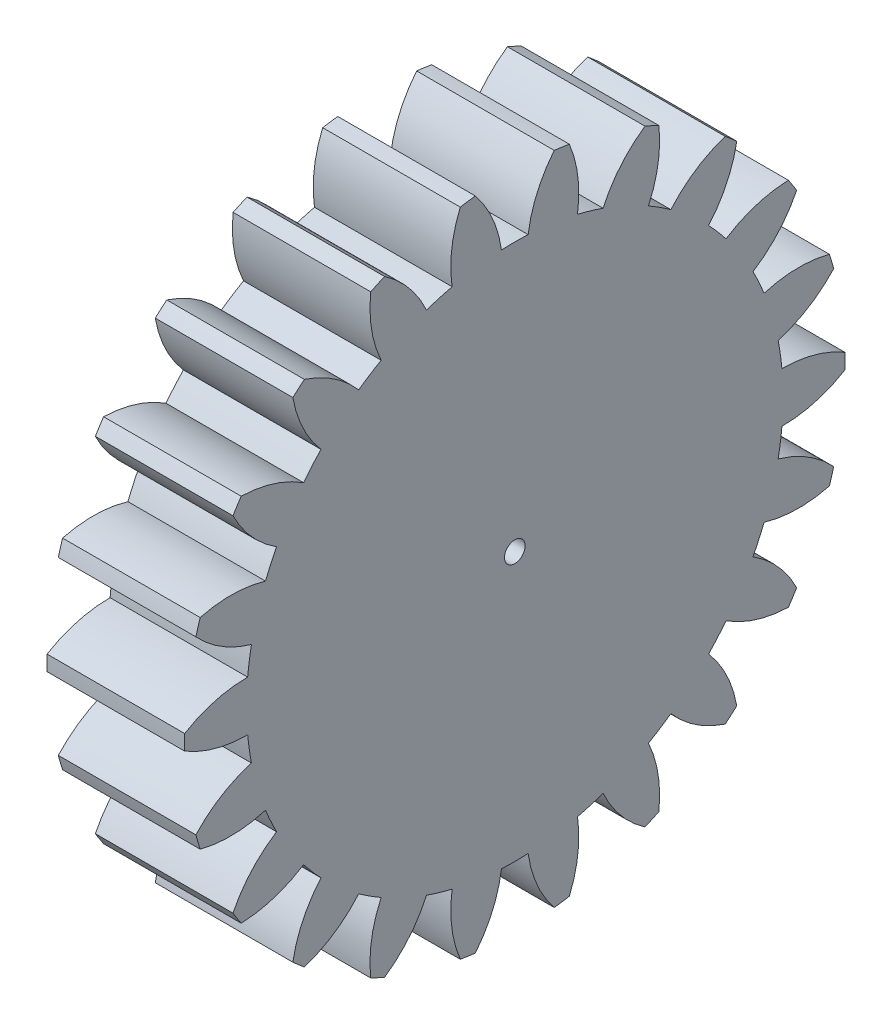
ISO-10303-21;
HEADER;
FILE_DESCRIPTION(('STEP AP214'),'2;1');
FILE_NAME('part.step','',(''),(''),'','','');
FILE_SCHEMA(('AUTOMOTIVE_DESIGN { 1 0 10303 214 1 1 1 1 }'));
ENDSEC;
DATA;
#1=APPLICATION_CONTEXT('core data for automotive mechanical design processes');
#2=APPLICATION_PROTOCOL_DEFINITION('international standard','automotive_design',2000,#1);
#3=PRODUCT_CONTEXT('',#1,'mechanical');
#4=PRODUCT('Part','Part','',(#3));
#5=PRODUCT_RELATED_PRODUCT_CATEGORY('part','',(#4));
#6=PRODUCT_DEFINITION_FORMATION('','',#4);
#7=PRODUCT_DEFINITION_CONTEXT('part definition',#1,'design');
#8=PRODUCT_DEFINITION('design','',#6,#7);
#9=PRODUCT_DEFINITION_SHAPE('','',#8);
#10=(LENGTH_UNIT() NAMED_UNIT(*) SI_UNIT(.MILLI.,.METRE.));
#11=(NAMED_UNIT(*) PLANE_ANGLE_UNIT() SI_UNIT($,.RADIAN.));
#12=(NAMED_UNIT(*) SI_UNIT($,.STERADIAN.) SOLID_ANGLE_UNIT());
#13=UNCERTAINTY_MEASURE_WITH_UNIT(LENGTH_MEASURE(1.E-05),#10,'distance_accuracy_value','');
#14=(GEOMETRIC_REPRESENTATION_CONTEXT(3) GLOBAL_UNCERTAINTY_ASSIGNED_CONTEXT((#13)) GLOBAL_UNIT_ASSIGNED_CONTEXT((#10,
#11,#12)) REPRESENTATION_CONTEXT('',''));
#15=CARTESIAN_POINT('',(0.,0.,0.));
#16=DIRECTION('',(0.,0.,1.));
#17=DIRECTION('',(1.,0.,0.));
#18=AXIS2_PLACEMENT_3D('',#15,#16,#17);
#19=CARTESIAN_POINT('',(10.,0.,0.));
#20=DIRECTION('',(-1.,0.,0.));
#21=DIRECTION('',(0.,0.,1.));
#22=AXIS2_PLACEMENT_3D('',#19,#20,#21);
#23=PLANE('',#22);
#24=CARTESIAN_POINT('',(10.,0.,0.));
#25=DIRECTION('',(-1.,0.,0.));
#26=DIRECTION('',(0.,0.,1.));
#27=AXIS2_PLACEMENT_3D('',#24,#25,#26);
#28=CIRCLE('',#27,0.75);
#29=CARTESIAN_POINT('',(10.,0.,0.75));
#30=VERTEX_POINT('',#29);
#31=EDGE_CURVE('E876',#30,#30,#28,.F.);
#32=ORIENTED_EDGE('',*,*,#31,.F.);
#33=EDGE_LOOP('',(#32));
#34=FACE_BOUND('',#33,.T.);
#35=CARTESIAN_POINT('',(10.,6.98663958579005,19.4568656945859));
#36=DIRECTION('',(-1.,0.,0.));
#37=DIRECTION('',(0.,0.989821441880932,0.142314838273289));
#38=AXIS2_PLACEMENT_3D('',#35,#36,#37);
#39=CIRCLE('',#38,8.8);
#40=CARTESIAN_POINT('',(10.,-1.81325846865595,19.4145073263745));
#41=VERTEX_POINT('',#40);
#42=CARTESIAN_POINT('',(10.,-0.553781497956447,23.9936101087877));
#43=VERTEX_POINT('',#42);
#44=EDGE_CURVE('E628',#41,#43,#39,.T.);
#45=ORIENTED_EDGE('',*,*,#44,.F.);
#46=CARTESIAN_POINT('',(10.,0.,0.));
#47=DIRECTION('',(-1.,0.,0.));
#48=DIRECTION('',(0.,0.989821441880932,0.142314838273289));
#49=AXIS2_PLACEMENT_3D('',#46,#47,#48);
#50=CIRCLE('',#49,19.499);
#51=CARTESIAN_POINT('',(10.,-3.72989002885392,19.1389373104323));
#52=VERTEX_POINT('',#51);
#53=EDGE_CURVE('E633',#52,#41,#50,.T.);
#54=ORIENTED_EDGE('',*,*,#53,.F.);
#55=CARTESIAN_POINT('',(10.,-12.1852641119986,16.7003620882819));
#56=DIRECTION('',(-1.,0.,0.));
#57=DIRECTION('',(0.,0.989821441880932,0.142314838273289));
#58=AXIS2_PLACEMENT_3D('',#55,#56,#57);
#59=CIRCLE('',#58,8.8);
#60=CARTESIAN_POINT('',(10.,-6.22843166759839,23.1777185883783));
#61=VERTEX_POINT('',#60);
#62=EDGE_CURVE('E630',#61,#52,#59,.T.);
#63=ORIENTED_EDGE('',*,*,#62,.F.);
#64=CARTESIAN_POINT('',(10.,0.,0.));
#65=DIRECTION('',(-1.,0.,0.));
#66=DIRECTION('',(0.,0.,1.));
#67=AXIS2_PLACEMENT_3D('',#64,#65,#66);
#68=CIRCLE('',#67,24.);
#69=CARTESIAN_POINT('',(10.,-7.29113058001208,22.8656820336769));
#70=VERTEX_POINT('',#69);
#71=EDGE_CURVE('E1225',#70,#61,#68,.T.);
#72=ORIENTED_EDGE('',*,*,#71,.F.);
#73=CARTESIAN_POINT('',(10.,1.22199907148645,20.6370897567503));
#74=DIRECTION('',(-1.,0.,0.));
#75=DIRECTION('',(0.,0.909631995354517,0.41541501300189));
#76=AXIS2_PLACEMENT_3D('',#73,#74,#75);
#77=CIRCLE('',#76,8.8);
#78=CARTESIAN_POINT('',(10.,-7.20950754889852,18.1172294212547));
#79=VERTEX_POINT('',#78);
#80=EDGE_CURVE('E746',#79,#70,#77,.T.);
#81=ORIENTED_EDGE('',*,*,#80,.F.);
#82=CARTESIAN_POINT('',(10.,0.,0.));
#83=DIRECTION('',(-1.,0.,0.));
#84=DIRECTION('',(0.,0.909631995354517,0.41541501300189));
#85=AXIS2_PLACEMENT_3D('',#82,#83,#84);
#86=CIRCLE('',#85,19.499);
#87=CARTESIAN_POINT('',(10.,-8.97086501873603,17.3128444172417));
#88=VERTEX_POINT('',#87);
#89=EDGE_CURVE('E751',#88,#79,#86,.T.);
#90=ORIENTED_EDGE('',*,*,#89,.F.);
#91=CARTESIAN_POINT('',(10.,-16.3967110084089,12.5908944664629));
#92=DIRECTION('',(-1.,0.,0.));
#93=DIRECTION('',(0.,0.909631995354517,0.41541501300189));
#94=AXIS2_PLACEMENT_3D('',#91,#92,#93);
#95=CIRCLE('',#94,8.8);
#96=CARTESIAN_POINT('',(10.,-12.5060543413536,20.4841061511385));
#97=VERTEX_POINT('',#96);
#98=EDGE_CURVE('E748',#97,#88,#95,.T.);
#99=ORIENTED_EDGE('',*,*,#98,.F.);
#100=CARTESIAN_POINT('',(10.,-13.4377956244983,19.8853123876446));
#101=VERTEX_POINT('',#100);
#102=EDGE_CURVE('E1203',#101,#97,#68,.T.);
#103=ORIENTED_EDGE('',*,*,#102,.F.);
#104=CARTESIAN_POINT('',(10.,-4.64164054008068,20.1454195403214));
#105=DIRECTION('',(-1.,0.,0.));
#106=DIRECTION('',(0.,0.755749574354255,0.654860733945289));
#107=AXIS2_PLACEMENT_3D('',#104,#105,#106);
#108=CIRCLE('',#107,8.8);
#109=CARTESIAN_POINT('',(10.,-12.0216852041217,15.3522013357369));
#110=VERTEX_POINT('',#109);
#111=EDGE_CURVE('E729',#110,#101,#108,.T.);
#112=ORIENTED_EDGE('',*,*,#111,.F.);
#113=CARTESIAN_POINT('',(10.,0.,0.));
#114=DIRECTION('',(-1.,0.,0.));
#115=DIRECTION('',(0.,0.755749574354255,0.654860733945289));
#116=AXIS2_PLACEMENT_3D('',#113,#114,#115);
#117=CIRCLE('',#116,19.499);
#118=CARTESIAN_POINT('',(10.,-13.4850738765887,14.0841678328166));
#119=VERTEX_POINT('',#118);
#120=EDGE_CURVE('E734',#119,#110,#117,.T.);
#121=ORIENTED_EDGE('',*,*,#120,.F.);
#122=CARTESIAN_POINT('',(10.,-19.279793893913,7.46138745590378));
#123=DIRECTION('',(-1.,0.,0.));
#124=DIRECTION('',(0.,0.755749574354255,0.654860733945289));
#125=AXIS2_PLACEMENT_3D('',#122,#123,#124);
#126=CIRCLE('',#125,8.8);
#127=CARTESIAN_POINT('',(10.,-17.7705108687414,16.1309932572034));
#128=VERTEX_POINT('',#127);
#129=EDGE_CURVE('E731',#128,#119,#126,.T.);
#130=ORIENTED_EDGE('',*,*,#129,.F.);
#131=CARTESIAN_POINT('',(10.,-18.4958103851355,15.2939529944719));
#132=VERTEX_POINT('',#131);
#133=EDGE_CURVE('E1325',#132,#128,#68,.T.);
#134=ORIENTED_EDGE('',*,*,#133,.F.);
#135=CARTESIAN_POINT('',(10.,-10.1292420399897,18.0216872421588));
#136=DIRECTION('',(-1.,0.,0.));
#137=DIRECTION('',(0.,0.540640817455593,0.841253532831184));
#138=AXIS2_PLACEMENT_3D('',#135,#136,#137);
#139=CIRCLE('',#138,8.8);
#140=CARTESIAN_POINT('',(10.,-15.8599374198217,11.3434292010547));
#141=VERTEX_POINT('',#140);
#142=EDGE_CURVE('E676',#141,#132,#139,.T.);
#143=ORIENTED_EDGE('',*,*,#142,.F.);
#144=CARTESIAN_POINT('',(10.,0.,0.));
#145=DIRECTION('',(-1.,0.,0.));
#146=DIRECTION('',(0.,0.540640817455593,0.841253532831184));
#147=AXIS2_PLACEMENT_3D('',#144,#145,#146);
#148=CIRCLE('',#147,19.499);
#149=CARTESIAN_POINT('',(10.,-16.9068022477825,9.71447573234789));
#150=VERTEX_POINT('',#149);
#151=EDGE_CURVE('E681',#150,#141,#148,.T.);
#152=ORIENTED_EDGE('',*,*,#151,.F.);
#153=CARTESIAN_POINT('',(10.,-20.6009425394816,1.72740320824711));
#154=DIRECTION('',(-1.,0.,0.));
#155=DIRECTION('',(0.,0.540640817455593,0.841253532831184));
#156=AXIS2_PLACEMENT_3D('',#153,#154,#155);
#157=CIRCLE('',#156,8.8);
#158=CARTESIAN_POINT('',(10.,-21.5953062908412,10.4710432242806));
#159=VERTEX_POINT('',#158);
#160=EDGE_CURVE('E678',#159,#150,#157,.T.);
#161=ORIENTED_EDGE('',*,*,#160,.F.);
#162=CARTESIAN_POINT('',(10.,-22.0554045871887,9.46356848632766));
#163=VERTEX_POINT('',#162);
#164=EDGE_CURVE('E1319',#163,#159,#68,.T.);
#165=ORIENTED_EDGE('',*,*,#164,.F.);
#166=CARTESIAN_POINT('',(10.,-14.7962325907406,14.4379450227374));
#167=DIRECTION('',(-1.,0.,0.));
#168=DIRECTION('',(0.,0.281732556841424,0.959492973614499));
#169=AXIS2_PLACEMENT_3D('',#166,#167,#168);
#170=CIRCLE('',#169,8.8);
#171=CARTESIAN_POINT('',(10.,-18.4133118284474,6.41567989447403));
#172=VERTEX_POINT('',#171);
#173=EDGE_CURVE('E695',#172,#163,#170,.T.);
#174=ORIENTED_EDGE('',*,*,#173,.F.);
#175=CARTESIAN_POINT('',(10.,0.,0.));
#176=DIRECTION('',(-1.,0.,0.));
#177=DIRECTION('',(0.,0.281732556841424,0.959492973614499));
#178=AXIS2_PLACEMENT_3D('',#175,#176,#177);
#179=CIRCLE('',#178,19.499);
#180=CARTESIAN_POINT('',(10.,-18.9588420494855,4.55777458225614));
#181=VERTEX_POINT('',#180);
#182=EDGE_CURVE('E700',#181,#172,#179,.T.);
#183=ORIENTED_EDGE('',*,*,#182,.F.);
#184=CARTESIAN_POINT('',(10.,-20.2531253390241,-4.14652497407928));
#185=DIRECTION('',(-1.,0.,0.));
#186=DIRECTION('',(0.,0.281732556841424,0.959492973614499));
#187=AXIS2_PLACEMENT_3D('',#184,#185,#186);
#188=CIRCLE('',#187,8.8);
#189=CARTESIAN_POINT('',(10.,-23.6705784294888,3.96279154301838));
#190=VERTEX_POINT('',#189);
#191=EDGE_CURVE('E697',#190,#181,#188,.T.);
#192=ORIENTED_EDGE('',*,*,#191,.F.);
#193=CARTESIAN_POINT('',(10.,-23.8282010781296,2.86650194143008));
#194=VERTEX_POINT('',#193);
#195=EDGE_CURVE('E1313',#194,#190,#68,.T.);
#196=ORIENTED_EDGE('',*,*,#195,.F.);
#197=CARTESIAN_POINT('',(10.,-18.2645203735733,9.68452636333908));
#198=DIRECTION('',(-1.,0.,0.));
#199=DIRECTION('',(0.,0.,1.));
#200=AXIS2_PLACEMENT_3D('',#197,#198,#199);
#201=CIRCLE('',#200,8.8);
#202=CARTESIAN_POINT('',(10.,-19.4749492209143,0.968170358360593));
#203=VERTEX_POINT('',#202);
#204=EDGE_CURVE('E712',#203,#194,#201,.T.);
#205=ORIENTED_EDGE('',*,*,#204,.F.);
#206=CARTESIAN_POINT('',(10.,0.,0.));
#207=DIRECTION('',(-1.,0.,0.));
#208=DIRECTION('',(0.,0.,1.));
#209=AXIS2_PLACEMENT_3D('',#206,#207,#208);
#210=CIRCLE('',#209,19.499);
#211=CARTESIAN_POINT('',(10.,-19.4749492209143,-0.968170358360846));
#212=VERTEX_POINT('',#211);
#213=EDGE_CURVE('E717',#212,#203,#210,.T.);
#214=ORIENTED_EDGE('',*,*,#213,.F.);
#215=CARTESIAN_POINT('',(10.,-18.2645203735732,-9.68452636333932));
#216=DIRECTION('',(-1.,0.,0.));
#217=DIRECTION('',(0.,0.,1.));
#218=AXIS2_PLACEMENT_3D('',#215,#216,#217);
#219=CIRCLE('',#218,8.8);
#220=CARTESIAN_POINT('',(10.,-23.8282010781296,-2.8665019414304));
#221=VERTEX_POINT('',#220);
#222=EDGE_CURVE('E714',#221,#212,#219,.T.);
#223=ORIENTED_EDGE('',*,*,#222,.F.);
#224=CARTESIAN_POINT('',(10.,-23.6705784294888,-3.9627915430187));
#225=VERTEX_POINT('',#224);
#226=EDGE_CURVE('E1307',#225,#221,#68,.T.);
#227=ORIENTED_EDGE('',*,*,#226,.F.);
#228=CARTESIAN_POINT('',(10.,-20.2531253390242,4.14652497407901));
#229=DIRECTION('',(-1.,0.,0.));
#230=DIRECTION('',(0.,-0.281732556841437,0.959492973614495));
#231=AXIS2_PLACEMENT_3D('',#228,#229,#230);
#232=CIRCLE('',#231,8.8);
#233=CARTESIAN_POINT('',(10.,-18.9588420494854,-4.5577745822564));
#234=VERTEX_POINT('',#233);
#235=EDGE_CURVE('E814',#234,#225,#232,.T.);
#236=ORIENTED_EDGE('',*,*,#235,.F.);
#237=CARTESIAN_POINT('',(10.,0.,0.));
#238=DIRECTION('',(-1.,0.,0.));
#239=DIRECTION('',(0.,-0.281732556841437,0.959492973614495));
#240=AXIS2_PLACEMENT_3D('',#237,#238,#239);
#241=CIRCLE('',#240,19.499);
#242=CARTESIAN_POINT('',(10.,-18.4133118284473,-6.41567989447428));
#243=VERTEX_POINT('',#242);
#244=EDGE_CURVE('E819',#243,#234,#241,.T.);
#245=ORIENTED_EDGE('',*,*,#244,.F.);
#246=CARTESIAN_POINT('',(10.,-14.7962325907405,-14.4379450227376));
#247=DIRECTION('',(-1.,0.,0.));
#248=DIRECTION('',(0.,-0.281732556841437,0.959492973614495));
#249=AXIS2_PLACEMENT_3D('',#246,#247,#248);
#250=CIRCLE('',#249,8.8);
#251=CARTESIAN_POINT('',(10.,-22.0554045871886,-9.46356848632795));
#252=VERTEX_POINT('',#251);
#253=EDGE_CURVE('E816',#252,#243,#250,.T.);
#254=ORIENTED_EDGE('',*,*,#253,.F.);
#255=CARTESIAN_POINT('',(10.,-21.5953062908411,-10.4710432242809));
#256=VERTEX_POINT('',#255);
#257=EDGE_CURVE('E1301',#256,#252,#68,.T.);
#258=ORIENTED_EDGE('',*,*,#257,.F.);
#259=CARTESIAN_POINT('',(10.,-20.6009425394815,-1.72740320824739));
#260=DIRECTION('',(-1.,0.,0.));
#261=DIRECTION('',(0.,-0.540640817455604,0.841253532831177));
#262=AXIS2_PLACEMENT_3D('',#259,#260,#261);
#263=CIRCLE('',#262,8.8);
#264=CARTESIAN_POINT('',(10.,-16.9068022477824,-9.71447573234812));
#265=VERTEX_POINT('',#264);
#266=EDGE_CURVE('E831',#265,#256,#263,.T.);
#267=ORIENTED_EDGE('',*,*,#266,.F.);
#268=CARTESIAN_POINT('',(10.,0.,0.));
#269=DIRECTION('',(-1.,0.,0.));
#270=DIRECTION('',(0.,-0.540640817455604,0.841253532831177));
#271=AXIS2_PLACEMENT_3D('',#268,#269,#270);
#272=CIRCLE('',#271,19.499);
#273=CARTESIAN_POINT('',(10.,-15.8599374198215,-11.3434292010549));
#274=VERTEX_POINT('',#273);
#275=EDGE_CURVE('E836',#274,#265,#272,.T.);
#276=ORIENTED_EDGE('',*,*,#275,.F.);
#277=CARTESIAN_POINT('',(10.,-10.1292420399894,-18.0216872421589));
#278=DIRECTION('',(-1.,0.,0.));
#279=DIRECTION('',(0.,-0.540640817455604,0.841253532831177));
#280=AXIS2_PLACEMENT_3D('',#277,#278,#279);
#281=CIRCLE('',#280,8.8);
#282=CARTESIAN_POINT('',(10.,-18.4958103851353,-15.2939529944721));
#283=VERTEX_POINT('',#282);
#284=EDGE_CURVE('E833',#283,#274,#281,.T.);
#285=ORIENTED_EDGE('',*,*,#284,.F.);
#286=CARTESIAN_POINT('',(10.,-17.7705108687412,-16.1309932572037));
#287=VERTEX_POINT('',#286);
#288=EDGE_CURVE('E1295',#287,#283,#68,.T.);
#289=ORIENTED_EDGE('',*,*,#288,.F.);
#290=CARTESIAN_POINT('',(10.,-19.2797938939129,-7.46138745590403));
#291=DIRECTION('',(-1.,0.,0.));
#292=DIRECTION('',(0.,-0.755749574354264,0.654860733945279));
#293=AXIS2_PLACEMENT_3D('',#290,#291,#292);
#294=CIRCLE('',#293,8.8);
#295=CARTESIAN_POINT('',(10.,-13.4850738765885,-14.0841678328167));
#296=VERTEX_POINT('',#295);
#297=EDGE_CURVE('E797',#296,#287,#294,.T.);
#298=ORIENTED_EDGE('',*,*,#297,.F.);
#299=CARTESIAN_POINT('',(10.,0.,0.));
#300=DIRECTION('',(-1.,0.,0.));
#301=DIRECTION('',(0.,-0.755749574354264,0.654860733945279));
#302=AXIS2_PLACEMENT_3D('',#299,#300,#301);
#303=CIRCLE('',#302,19.499);
#304=CARTESIAN_POINT('',(10.,-12.0216852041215,-15.3522013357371));
#305=VERTEX_POINT('',#304);
#306=EDGE_CURVE('E802',#305,#296,#303,.T.);
#307=ORIENTED_EDGE('',*,*,#306,.F.);
#308=CARTESIAN_POINT('',(10.,-4.64164054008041,-20.1454195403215));
#309=DIRECTION('',(-1.,0.,0.));
#310=DIRECTION('',(0.,-0.755749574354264,0.654860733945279));
#311=AXIS2_PLACEMENT_3D('',#308,#309,#310);
#312=CIRCLE('',#311,8.8);
#313=CARTESIAN_POINT('',(10.,-13.4377956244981,-19.8853123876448));
#314=VERTEX_POINT('',#313);
#315=EDGE_CURVE('E799',#314,#305,#312,.T.);
#316=ORIENTED_EDGE('',*,*,#315,.F.);
#317=CARTESIAN_POINT('',(10.,-12.5060543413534,-20.4841061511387));
#318=VERTEX_POINT('',#317);
#319=EDGE_CURVE('E1289',#318,#314,#68,.T.);
#320=ORIENTED_EDGE('',*,*,#319,.F.);
#321=CARTESIAN_POINT('',(10.,-16.3967110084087,-12.5908944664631));
#322=DIRECTION('',(-1.,0.,0.));
#323=DIRECTION('',(0.,-0.909631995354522,0.415415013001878));
#324=AXIS2_PLACEMENT_3D('',#321,#322,#323);
#325=CIRCLE('',#324,8.8);
#326=CARTESIAN_POINT('',(10.,-8.97086501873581,-17.3128444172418));
#327=VERTEX_POINT('',#326);
#328=EDGE_CURVE('E761',#327,#318,#325,.T.);
#329=ORIENTED_EDGE('',*,*,#328,.F.);
#330=CARTESIAN_POINT('',(10.,0.,0.));
#331=DIRECTION('',(-1.,0.,0.));
#332=DIRECTION('',(0.,-0.909631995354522,0.415415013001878));
#333=AXIS2_PLACEMENT_3D('',#330,#331,#332);
#334=CIRCLE('',#333,19.499);
#335=CARTESIAN_POINT('',(10.,-7.20950754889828,-18.1172294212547));
#336=VERTEX_POINT('',#335);
#337=EDGE_CURVE('E766',#336,#327,#334,.T.);
#338=ORIENTED_EDGE('',*,*,#337,.F.);
#339=CARTESIAN_POINT('',(10.,1.22199907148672,-20.6370897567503));
#340=DIRECTION('',(-1.,0.,0.));
#341=DIRECTION('',(0.,-0.909631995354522,0.415415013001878));
#342=AXIS2_PLACEMENT_3D('',#339,#340,#341);
#343=CIRCLE('',#342,8.8);
#344=CARTESIAN_POINT('',(10.,-7.29113058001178,-22.865682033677));
#345=VERTEX_POINT('',#344);
#346=EDGE_CURVE('E763',#345,#336,#343,.T.);
#347=ORIENTED_EDGE('',*,*,#346,.F.);
#348=CARTESIAN_POINT('',(10.,-6.22843166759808,-23.1777185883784));
#349=VERTEX_POINT('',#348);
#350=EDGE_CURVE('E1283',#349,#345,#68,.T.);
#351=ORIENTED_EDGE('',*,*,#350,.F.);
#352=CARTESIAN_POINT('',(10.,-12.1852641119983,-16.7003620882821));
#353=DIRECTION('',(-1.,0.,0.));
#354=DIRECTION('',(0.,-0.989821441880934,0.142314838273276));
#355=AXIS2_PLACEMENT_3D('',#352,#353,#354);
#356=CIRCLE('',#355,8.8);
#357=CARTESIAN_POINT('',(10.,-3.72989002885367,-19.1389373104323));
#358=VERTEX_POINT('',#357);
#359=EDGE_CURVE('E780',#358,#349,#356,.T.);
#360=ORIENTED_EDGE('',*,*,#359,.F.);
#361=CARTESIAN_POINT('',(10.,0.,0.));
#362=DIRECTION('',(-1.,0.,0.));
#363=DIRECTION('',(0.,-0.989821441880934,0.142314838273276));
#364=AXIS2_PLACEMENT_3D('',#361,#362,#363);
#365=CIRCLE('',#364,19.499);
#366=CARTESIAN_POINT('',(10.,-1.81325846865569,-19.4145073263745));
#367=VERTEX_POINT('',#366);
#368=EDGE_CURVE('E785',#367,#358,#365,.T.);
#369=ORIENTED_EDGE('',*,*,#368,.F.);
#370=CARTESIAN_POINT('',(10.,6.98663958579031,-19.4568656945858));
#371=DIRECTION('',(-1.,0.,0.));
#372=DIRECTION('',(0.,-0.989821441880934,0.142314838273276));
#373=AXIS2_PLACEMENT_3D('',#370,#371,#372);
#374=CIRCLE('',#373,8.8);
#375=CARTESIAN_POINT('',(10.,-0.553781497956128,-23.9936101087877));
#376=VERTEX_POINT('',#375);
#377=EDGE_CURVE('E782',#376,#367,#374,.T.);
#378=ORIENTED_EDGE('',*,*,#377,.F.);
#379=CARTESIAN_POINT('',(10.,0.553781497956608,-23.9936101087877));
#380=VERTEX_POINT('',#379);
#381=EDGE_CURVE('E1277',#380,#376,#68,.T.);
#382=ORIENTED_EDGE('',*,*,#381,.F.);
#383=CARTESIAN_POINT('',(10.,-6.98663958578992,-19.456865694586));
#384=DIRECTION('',(-1.,0.,0.));
#385=DIRECTION('',(0.,-0.989821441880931,-0.142314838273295));
#386=AXIS2_PLACEMENT_3D('',#383,#384,#385);
#387=CIRCLE('',#386,8.8);
#388=CARTESIAN_POINT('',(10.,1.81325846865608,-19.4145073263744));
#389=VERTEX_POINT('',#388);
#390=EDGE_CURVE('E899',#389,#380,#387,.T.);
#391=ORIENTED_EDGE('',*,*,#390,.F.);
#392=CARTESIAN_POINT('',(10.,0.,0.));
#393=DIRECTION('',(-1.,0.,0.));
#394=DIRECTION('',(0.,-0.989821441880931,-0.142314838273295));
#395=AXIS2_PLACEMENT_3D('',#392,#393,#394);
#396=CIRCLE('',#395,19.499);
#397=CARTESIAN_POINT('',(10.,3.72989002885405,-19.1389373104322));
#398=VERTEX_POINT('',#397);
#399=EDGE_CURVE('E904',#398,#389,#396,.T.);
#400=ORIENTED_EDGE('',*,*,#399,.F.);
#401=CARTESIAN_POINT('',(10.,12.1852641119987,-16.7003620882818));
#402=DIRECTION('',(-1.,0.,0.));
#403=DIRECTION('',(0.,-0.989821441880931,-0.142314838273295));
#404=AXIS2_PLACEMENT_3D('',#401,#402,#403);
#405=CIRCLE('',#404,8.8);
#406=CARTESIAN_POINT('',(10.,6.22843166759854,-23.1777185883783));
#407=VERTEX_POINT('',#406);
#408=EDGE_CURVE('E901',#407,#398,#405,.T.);
#409=ORIENTED_EDGE('',*,*,#408,.F.);
#410=CARTESIAN_POINT('',(10.,7.29113058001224,-22.8656820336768));
#411=VERTEX_POINT('',#410);
#412=EDGE_CURVE('E1271',#411,#407,#68,.T.);
#413=ORIENTED_EDGE('',*,*,#412,.F.);
#414=CARTESIAN_POINT('',(10.,-1.22199907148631,-20.6370897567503));
#415=DIRECTION('',(-1.,0.,0.));
#416=DIRECTION('',(0.,-0.909631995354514,-0.415415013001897));
#417=AXIS2_PLACEMENT_3D('',#414,#415,#416);
#418=CIRCLE('',#417,8.8);
#419=CARTESIAN_POINT('',(10.,7.20950754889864,-18.1172294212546));
#420=VERTEX_POINT('',#419);
#421=EDGE_CURVE('E916',#420,#411,#418,.T.);
#422=ORIENTED_EDGE('',*,*,#421,.F.);
#423=CARTESIAN_POINT('',(10.,0.,0.));
#424=DIRECTION('',(-1.,0.,0.));
#425=DIRECTION('',(0.,-0.909631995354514,-0.415415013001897));
#426=AXIS2_PLACEMENT_3D('',#423,#424,#425);
#427=CIRCLE('',#426,19.499);
#428=CARTESIAN_POINT('',(10.,8.97086501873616,-17.3128444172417));
#429=VERTEX_POINT('',#428);
#430=EDGE_CURVE('E921',#429,#420,#427,.T.);
#431=ORIENTED_EDGE('',*,*,#430,.F.);
#432=CARTESIAN_POINT('',(10.,16.396711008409,-12.5908944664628));
#433=DIRECTION('',(-1.,0.,0.));
#434=DIRECTION('',(0.,-0.909631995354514,-0.415415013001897));
#435=AXIS2_PLACEMENT_3D('',#432,#433,#434);
#436=CIRCLE('',#435,8.8);
#437=CARTESIAN_POINT('',(10.,12.5060543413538,-20.4841061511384));
#438=VERTEX_POINT('',#437);
#439=EDGE_CURVE('E918',#438,#429,#436,.T.);
#440=ORIENTED_EDGE('',*,*,#439,.F.);
#441=CARTESIAN_POINT('',(10.,13.4377956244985,-19.8853123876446));
#442=VERTEX_POINT('',#441);
#443=EDGE_CURVE('E1265',#442,#438,#68,.T.);
#444=ORIENTED_EDGE('',*,*,#443,.F.);
#445=CARTESIAN_POINT('',(10.,4.64164054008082,-20.1454195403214));
#446=DIRECTION('',(-1.,0.,0.));
#447=DIRECTION('',(0.,-0.755749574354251,-0.654860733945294));
#448=AXIS2_PLACEMENT_3D('',#445,#446,#447);
#449=CIRCLE('',#448,8.8);
#450=CARTESIAN_POINT('',(10.,12.0216852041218,-15.3522013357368));
#451=VERTEX_POINT('',#450);
#452=EDGE_CURVE('E882',#451,#442,#449,.T.);
#453=ORIENTED_EDGE('',*,*,#452,.F.);
#454=CARTESIAN_POINT('',(10.,0.,0.));
#455=DIRECTION('',(-1.,0.,0.));
#456=DIRECTION('',(0.,-0.755749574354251,-0.654860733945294));
#457=AXIS2_PLACEMENT_3D('',#454,#455,#456);
#458=CIRCLE('',#457,19.499);
#459=CARTESIAN_POINT('',(10.,13.4850738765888,-14.0841678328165));
#460=VERTEX_POINT('',#459);
#461=EDGE_CURVE('E887',#460,#451,#458,.T.);
#462=ORIENTED_EDGE('',*,*,#461,.F.);
#463=CARTESIAN_POINT('',(10.,19.2797938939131,-7.46138745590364));
#464=DIRECTION('',(-1.,0.,0.));
#465=DIRECTION('',(0.,-0.755749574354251,-0.654860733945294));
#466=AXIS2_PLACEMENT_3D('',#463,#464,#465);
#467=CIRCLE('',#466,8.8);
#468=CARTESIAN_POINT('',(10.,17.7705108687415,-16.1309932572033));
#469=VERTEX_POINT('',#468);
#470=EDGE_CURVE('E884',#469,#460,#467,.T.);
#471=ORIENTED_EDGE('',*,*,#470,.F.);
#472=CARTESIAN_POINT('',(10.,18.4958103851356,-15.2939529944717));
#473=VERTEX_POINT('',#472);
#474=EDGE_CURVE('E1259',#473,#469,#68,.T.);
#475=ORIENTED_EDGE('',*,*,#474,.F.);
#476=CARTESIAN_POINT('',(10.,10.1292420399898,-18.0216872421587));
#477=DIRECTION('',(-1.,0.,0.));
#478=DIRECTION('',(0.,-0.540640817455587,-0.841253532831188));
#479=AXIS2_PLACEMENT_3D('',#476,#477,#478);
#480=CIRCLE('',#479,8.8);
#481=CARTESIAN_POINT('',(10.,15.8599374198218,-11.3434292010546));
#482=VERTEX_POINT('',#481);
#483=EDGE_CURVE('E846',#482,#473,#480,.T.);
#484=ORIENTED_EDGE('',*,*,#483,.F.);
#485=CARTESIAN_POINT('',(10.,0.,0.));
#486=DIRECTION('',(-1.,0.,0.));
#487=DIRECTION('',(0.,-0.540640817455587,-0.841253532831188));
#488=AXIS2_PLACEMENT_3D('',#485,#486,#487);
#489=CIRCLE('',#488,19.499);
#490=CARTESIAN_POINT('',(10.,16.9068022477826,-9.71447573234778));
#491=VERTEX_POINT('',#490);
#492=EDGE_CURVE('E851',#491,#482,#489,.T.);
#493=ORIENTED_EDGE('',*,*,#492,.F.);
#494=CARTESIAN_POINT('',(10.,20.6009425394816,-1.72740320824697));
#495=DIRECTION('',(-1.,0.,0.));
#496=DIRECTION('',(0.,-0.540640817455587,-0.841253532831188));
#497=AXIS2_PLACEMENT_3D('',#494,#495,#496);
#498=CIRCLE('',#497,8.8);
#499=CARTESIAN_POINT('',(10.,21.5953062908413,-10.4710432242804));
#500=VERTEX_POINT('',#499);
#501=EDGE_CURVE('E848',#500,#491,#498,.T.);
#502=ORIENTED_EDGE('',*,*,#501,.F.);
#503=CARTESIAN_POINT('',(10.,22.0554045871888,-9.46356848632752));
#504=VERTEX_POINT('',#503);
#505=EDGE_CURVE('E1064',#504,#500,#68,.T.);
#506=ORIENTED_EDGE('',*,*,#505,.F.);
#507=CARTESIAN_POINT('',(10.,14.7962325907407,-14.4379450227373));
#508=DIRECTION('',(-1.,0.,0.));
#509=DIRECTION('',(0.,-0.281732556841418,-0.959492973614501));
#510=AXIS2_PLACEMENT_3D('',#507,#508,#509);
#511=CIRCLE('',#510,8.8);
#512=CARTESIAN_POINT('',(10.,18.4133118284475,-6.41567989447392));
#513=VERTEX_POINT('',#512);
#514=EDGE_CURVE('E865',#513,#504,#511,.T.);
#515=ORIENTED_EDGE('',*,*,#514,.F.);
#516=CARTESIAN_POINT('',(10.,0.,0.));
#517=DIRECTION('',(-1.,0.,0.));
#518=DIRECTION('',(0.,-0.281732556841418,-0.959492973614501));
#519=AXIS2_PLACEMENT_3D('',#516,#517,#518);
#520=CIRCLE('',#519,19.499);
#521=CARTESIAN_POINT('',(10.,18.9588420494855,-4.55777458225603));
#522=VERTEX_POINT('',#521);
#523=EDGE_CURVE('E870',#522,#513,#520,.T.);
#524=ORIENTED_EDGE('',*,*,#523,.F.);
#525=CARTESIAN_POINT('',(10.,20.2531253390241,4.14652497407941));
#526=DIRECTION('',(-1.,0.,0.));
#527=DIRECTION('',(0.,-0.281732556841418,-0.959492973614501));
#528=AXIS2_PLACEMENT_3D('',#525,#526,#527);
#529=CIRCLE('',#528,8.8);
#530=CARTESIAN_POINT('',(10.,23.6705784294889,-3.96279154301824));
#531=VERTEX_POINT('',#530);
#532=EDGE_CURVE('E867',#531,#522,#529,.T.);
#533=ORIENTED_EDGE('',*,*,#532,.F.);
#534=CARTESIAN_POINT('',(10.,23.8282010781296,-2.86650194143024));
#535=VERTEX_POINT('',#534);
#536=EDGE_CURVE('E1060',#535,#531,#68,.T.);
#537=ORIENTED_EDGE('',*,*,#536,.F.);
#538=CARTESIAN_POINT('',(10.,18.2645203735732,-9.6845263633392));
#539=DIRECTION('',(-1.,0.,0.));
#540=DIRECTION('',(0.,0.,-1.));
#541=AXIS2_PLACEMENT_3D('',#538,#539,#540);
#542=CIRCLE('',#541,8.8);
#543=CARTESIAN_POINT('',(10.,19.4749492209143,-0.968170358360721));
#544=VERTEX_POINT('',#543);
#545=EDGE_CURVE('E1032',#544,#535,#542,.T.);
#546=ORIENTED_EDGE('',*,*,#545,.F.);
#547=CARTESIAN_POINT('',(10.,0.,0.));
#548=DIRECTION('',(-1.,0.,0.));
#549=DIRECTION('',(0.,0.,-1.));
#550=AXIS2_PLACEMENT_3D('',#547,#548,#549);
#551=CIRCLE('',#550,19.499);
#552=CARTESIAN_POINT('',(10.,19.4749492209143,0.968170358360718));
#553=VERTEX_POINT('',#552);
#554=EDGE_CURVE('E1037',#553,#544,#551,.T.);
#555=ORIENTED_EDGE('',*,*,#554,.F.);
#556=CARTESIAN_POINT('',(10.,18.2645203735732,9.6845263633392));
#557=DIRECTION('',(-1.,0.,0.));
#558=DIRECTION('',(0.,0.,-1.));
#559=AXIS2_PLACEMENT_3D('',#556,#557,#558);
#560=CIRCLE('',#559,8.8);
#561=CARTESIAN_POINT('',(10.,23.8282010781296,2.86650194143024));
#562=VERTEX_POINT('',#561);
#563=EDGE_CURVE('E1034',#562,#553,#560,.T.);
#564=ORIENTED_EDGE('',*,*,#563,.F.);
#565=CARTESIAN_POINT('',(10.,23.6705784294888,3.96279154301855));
#566=VERTEX_POINT('',#565);
#567=EDGE_CURVE('E1057',#566,#562,#68,.T.);
#568=ORIENTED_EDGE('',*,*,#567,.F.);
#569=CARTESIAN_POINT('',(10.,20.2531253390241,-4.14652497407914));
#570=DIRECTION('',(-1.,0.,0.));
#571=DIRECTION('',(0.,0.28173255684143,-0.959492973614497));
#572=AXIS2_PLACEMENT_3D('',#569,#570,#571);
#573=CIRCLE('',#572,8.8);
#574=CARTESIAN_POINT('',(10.,18.9588420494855,4.55777458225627));
#575=VERTEX_POINT('',#574);
#576=EDGE_CURVE('E1010',#575,#566,#573,.T.);
#577=ORIENTED_EDGE('',*,*,#576,.F.);
#578=CARTESIAN_POINT('',(10.,0.,0.));
#579=DIRECTION('',(-1.,0.,0.));
#580=DIRECTION('',(0.,0.28173255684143,-0.959492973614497));
#581=AXIS2_PLACEMENT_3D('',#578,#579,#580);
#582=CIRCLE('',#581,19.499);
#583=CARTESIAN_POINT('',(10.,18.4133118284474,6.41567989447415));
#584=VERTEX_POINT('',#583);
#585=EDGE_CURVE('E1015',#584,#575,#582,.T.);
#586=ORIENTED_EDGE('',*,*,#585,.F.);
#587=CARTESIAN_POINT('',(10.,14.7962325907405,14.4379450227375));
#588=DIRECTION('',(-1.,0.,0.));
#589=DIRECTION('',(0.,0.28173255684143,-0.959492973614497));
#590=AXIS2_PLACEMENT_3D('',#587,#588,#589);
#591=CIRCLE('',#590,8.8);
#592=CARTESIAN_POINT('',(10.,22.0554045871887,9.46356848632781));
#593=VERTEX_POINT('',#592);
#594=EDGE_CURVE('E1012',#593,#584,#591,.T.);
#595=ORIENTED_EDGE('',*,*,#594,.F.);
#596=CARTESIAN_POINT('',(10.,21.5953062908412,10.4710432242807));
#597=VERTEX_POINT('',#596);
#598=EDGE_CURVE('E1065',#597,#593,#68,.T.);
#599=ORIENTED_EDGE('',*,*,#598,.F.);
#600=CARTESIAN_POINT('',(10.,20.6009425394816,1.72740320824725));
#601=DIRECTION('',(-1.,0.,0.));
#602=DIRECTION('',(0.,0.540640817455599,-0.841253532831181));
#603=AXIS2_PLACEMENT_3D('',#600,#601,#602);
#604=CIRCLE('',#603,8.8);
#605=CARTESIAN_POINT('',(10.,16.9068022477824,9.71447573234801));
#606=VERTEX_POINT('',#605);
#607=EDGE_CURVE('E659',#606,#597,#604,.T.);
#608=ORIENTED_EDGE('',*,*,#607,.F.);
#609=CARTESIAN_POINT('',(10.,0.,0.));
#610=DIRECTION('',(-1.,0.,0.));
#611=DIRECTION('',(0.,0.540640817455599,-0.841253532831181));
#612=AXIS2_PLACEMENT_3D('',#609,#610,#611);
#613=CIRCLE('',#612,19.499);
#614=CARTESIAN_POINT('',(10.,15.8599374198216,11.3434292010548));
#615=VERTEX_POINT('',#614);
#616=EDGE_CURVE('E664',#615,#606,#613,.T.);
#617=ORIENTED_EDGE('',*,*,#616,.F.);
#618=CARTESIAN_POINT('',(10.,10.1292420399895,18.0216872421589));
#619=DIRECTION('',(-1.,0.,0.));
#620=DIRECTION('',(0.,0.540640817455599,-0.841253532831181));
#621=AXIS2_PLACEMENT_3D('',#618,#619,#620);
#622=CIRCLE('',#621,8.8);
#623=CARTESIAN_POINT('',(10.,18.4958103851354,15.293952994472));
#624=VERTEX_POINT('',#623);
#625=EDGE_CURVE('E661',#624,#615,#622,.T.);
#626=ORIENTED_EDGE('',*,*,#625,.F.);
#627=CARTESIAN_POINT('',(10.,17.7705108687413,16.1309932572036));
#628=VERTEX_POINT('',#627);
#629=EDGE_CURVE('E1241',#628,#624,#68,.T.);
#630=ORIENTED_EDGE('',*,*,#629,.F.);
#631=CARTESIAN_POINT('',(10.,19.279793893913,7.46138745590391));
#632=DIRECTION('',(-1.,0.,0.));
#633=DIRECTION('',(0.,0.755749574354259,-0.654860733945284));
#634=AXIS2_PLACEMENT_3D('',#631,#632,#633);
#635=CIRCLE('',#634,8.8);
#636=CARTESIAN_POINT('',(10.,13.4850738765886,14.0841678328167));
#637=VERTEX_POINT('',#636);
#638=EDGE_CURVE('E642',#637,#628,#635,.T.);
#639=ORIENTED_EDGE('',*,*,#638,.F.);
#640=CARTESIAN_POINT('',(10.,0.,0.));
#641=DIRECTION('',(-1.,0.,0.));
#642=DIRECTION('',(0.,0.755749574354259,-0.654860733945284));
#643=AXIS2_PLACEMENT_3D('',#640,#641,#642);
#644=CIRCLE('',#643,19.499);
#645=CARTESIAN_POINT('',(10.,12.0216852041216,15.352201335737));
#646=VERTEX_POINT('',#645);
#647=EDGE_CURVE('E647',#646,#637,#644,.T.);
#648=ORIENTED_EDGE('',*,*,#647,.F.);
#649=CARTESIAN_POINT('',(10.,4.64164054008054,20.1454195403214));
#650=DIRECTION('',(-1.,0.,0.));
#651=DIRECTION('',(0.,0.755749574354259,-0.654860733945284));
#652=AXIS2_PLACEMENT_3D('',#649,#650,#651);
#653=CIRCLE('',#652,8.8);
#654=CARTESIAN_POINT('',(10.,13.4377956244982,19.8853123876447));
#655=VERTEX_POINT('',#654);
#656=EDGE_CURVE('E644',#655,#646,#653,.T.);
#657=ORIENTED_EDGE('',*,*,#656,.F.);
#658=CARTESIAN_POINT('',(10.,12.5060543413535,20.4841061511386));
#659=VERTEX_POINT('',#658);
#660=EDGE_CURVE('E1237',#659,#655,#68,.T.);
#661=ORIENTED_EDGE('',*,*,#660,.F.);
#662=CARTESIAN_POINT('',(10.,16.3967110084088,12.590894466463));
#663=DIRECTION('',(-1.,0.,0.));
#664=DIRECTION('',(0.,0.90963199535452,-0.415415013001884));
#665=AXIS2_PLACEMENT_3D('',#662,#663,#664);
#666=CIRCLE('',#665,8.8);
#667=CARTESIAN_POINT('',(10.,8.97086501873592,17.3128444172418));
#668=VERTEX_POINT('',#667);
#669=EDGE_CURVE('E590',#668,#659,#666,.T.);
#670=ORIENTED_EDGE('',*,*,#669,.F.);
#671=CARTESIAN_POINT('',(10.,0.,0.));
#672=DIRECTION('',(-1.,0.,0.));
#673=DIRECTION('',(0.,0.90963199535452,-0.415415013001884));
#674=AXIS2_PLACEMENT_3D('',#671,#672,#673);
#675=CIRCLE('',#674,19.499);
#676=CARTESIAN_POINT('',(10.,7.2095075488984,18.1172294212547));
#677=VERTEX_POINT('',#676);
#678=EDGE_CURVE('E589',#677,#668,#675,.T.);
#679=ORIENTED_EDGE('',*,*,#678,.F.);
#680=CARTESIAN_POINT('',(10.,-1.22199907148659,20.6370897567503));
#681=DIRECTION('',(-1.,0.,0.));
#682=DIRECTION('',(0.,0.90963199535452,-0.415415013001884));
#683=AXIS2_PLACEMENT_3D('',#680,#681,#682);
#684=CIRCLE('',#683,8.8);
#685=CARTESIAN_POINT('',(10.,7.29113058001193,22.8656820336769));
#686=VERTEX_POINT('',#685);
#687=EDGE_CURVE('E578',#686,#677,#684,.T.);
#688=ORIENTED_EDGE('',*,*,#687,.F.);
#689=CARTESIAN_POINT('',(10.,6.22843166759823,23.1777185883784));
#690=VERTEX_POINT('',#689);
#691=EDGE_CURVE('E1236',#690,#686,#68,.T.);
#692=ORIENTED_EDGE('',*,*,#691,.F.);
#693=CARTESIAN_POINT('',(10.,12.1852641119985,16.700362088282));
#694=DIRECTION('',(-1.,0.,0.));
#695=DIRECTION('',(0.,0.989821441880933,-0.142314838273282));
#696=AXIS2_PLACEMENT_3D('',#693,#694,#695);
#697=CIRCLE('',#696,8.8);
#698=CARTESIAN_POINT('',(10.,3.72989002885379,19.1389373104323));
#699=VERTEX_POINT('',#698);
#700=EDGE_CURVE('E614',#699,#690,#697,.T.);
#701=ORIENTED_EDGE('',*,*,#700,.F.);
#702=CARTESIAN_POINT('',(10.,0.,0.));
#703=DIRECTION('',(-1.,0.,0.));
#704=DIRECTION('',(0.,0.989821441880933,-0.142314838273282));
#705=AXIS2_PLACEMENT_3D('',#702,#703,#704);
#706=CIRCLE('',#705,19.499);
#707=CARTESIAN_POINT('',(10.,1.81325846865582,19.4145073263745));
#708=VERTEX_POINT('',#707);
#709=EDGE_CURVE('E619',#708,#699,#706,.T.);
#710=ORIENTED_EDGE('',*,*,#709,.F.);
#711=CARTESIAN_POINT('',(10.,-6.98663958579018,19.4568656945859));
#712=DIRECTION('',(-1.,0.,0.));
#713=DIRECTION('',(0.,0.989821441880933,-0.142314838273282));
#714=AXIS2_PLACEMENT_3D('',#711,#712,#713);
#715=CIRCLE('',#714,8.8);
#716=CARTESIAN_POINT('',(10.,0.553781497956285,23.9936101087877));
#717=VERTEX_POINT('',#716);
#718=EDGE_CURVE('E616',#717,#708,#715,.T.);
#719=ORIENTED_EDGE('',*,*,#718,.F.);
#720=EDGE_CURVE('E1123',#43,#717,#68,.T.);
#721=ORIENTED_EDGE('',*,*,#720,.F.);
#722=EDGE_LOOP('',(#45,#54,#63,#72,#81,#90,#99,#103,#112,#121,#130,#134,#143,#152,#161,#165,
#174,#183,#192,#196,#205,#214,#223,#227,#236,#245,#254,#258,#267,#276,#285,#289,#298,#307,#316,
#320,#329,#338,#347,#351,#360,#369,#378,#382,#391,#400,#409,#413,#422,#431,#440,#444,#453,#462,
#471,#475,#484,#493,#502,#506,#515,#524,#533,#537,#546,#555,#564,#568,#577,#586,#595,#599,#608,
#617,#626,#630,#639,#648,#657,#661,#670,#679,#688,#692,#701,#710,#719,#721));
#723=FACE_BOUND('',#722,.T.);
#724=ADVANCED_FACE('F33',(#34,#723),#23,.F.);
#725=CARTESIAN_POINT('',(-10.,0.,0.));
#726=DIRECTION('',(-1.,0.,0.));
#727=DIRECTION('',(0.,0.,1.));
#728=AXIS2_PLACEMENT_3D('',#725,#726,#727);
#729=CYLINDRICAL_SURFACE('',#728,24.);
#730=DIRECTION('',(-1.,0.,0.));
#731=VECTOR('',#730,1.);
#732=CARTESIAN_POINT('',(5.,-0.553781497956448,23.9936101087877));
#733=LINE('',#732,#731);
#734=CARTESIAN_POINT('',(0.,-0.55378149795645,23.9936101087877));
#735=VERTEX_POINT('',#734);
#736=EDGE_CURVE('E1007',#43,#735,#733,.T.);
#737=ORIENTED_EDGE('',*,*,#736,.F.);
#738=ORIENTED_EDGE('',*,*,#720,.T.);
#739=DIRECTION('',(-1.,0.,0.));
#740=VECTOR('',#739,1.);
#741=CARTESIAN_POINT('',(5.,0.553781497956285,23.9936101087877));
#742=LINE('',#741,#740);
#743=CARTESIAN_POINT('',(0.,0.553781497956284,23.9936101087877));
#744=VERTEX_POINT('',#743);
#745=EDGE_CURVE('E1001',#744,#717,#742,.F.);
#746=ORIENTED_EDGE('',*,*,#745,.F.);
#747=CARTESIAN_POINT('',(0.,0.,0.));
#748=DIRECTION('',(-1.,0.,0.));
#749=DIRECTION('',(0.,0.,1.));
#750=AXIS2_PLACEMENT_3D('',#747,#748,#749);
#751=CIRCLE('',#750,24.);
#752=EDGE_CURVE('E1121',#735,#744,#751,.T.);
#753=ORIENTED_EDGE('',*,*,#752,.F.);
#754=EDGE_LOOP('',(#737,#738,#746,#753));
#755=FACE_BOUND('',#754,.T.);
#756=ADVANCED_FACE('F1120',(#755),#729,.T.);
#757=DIRECTION('',(-1.,0.,0.));
#758=VECTOR('',#757,1.);
#759=CARTESIAN_POINT('',(5.,-6.22843166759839,23.1777185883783));
#760=LINE('',#759,#758);
#761=CARTESIAN_POINT('',(0.,-6.22843166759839,23.1777185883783));
#762=VERTEX_POINT('',#761);
#763=EDGE_CURVE('E1005',#762,#61,#760,.F.);
#764=ORIENTED_EDGE('',*,*,#763,.F.);
#765=CARTESIAN_POINT('',(0.,-7.29113058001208,22.8656820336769));
#766=VERTEX_POINT('',#765);
#767=EDGE_CURVE('E1125',#766,#762,#751,.T.);
#768=ORIENTED_EDGE('',*,*,#767,.F.);
#769=DIRECTION('',(-1.,0.,0.));
#770=VECTOR('',#769,1.);
#771=CARTESIAN_POINT('',(5.,-7.29113058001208,22.8656820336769));
#772=LINE('',#771,#770);
#773=EDGE_CURVE('E976',#70,#766,#772,.T.);
#774=ORIENTED_EDGE('',*,*,#773,.F.);
#775=ORIENTED_EDGE('',*,*,#71,.T.);
#776=EDGE_LOOP('',(#764,#768,#774,#775));
#777=FACE_BOUND('',#776,.T.);
#778=ADVANCED_FACE('F1223',(#777),#729,.T.);
#779=DIRECTION('',(-1.,0.,0.));
#780=VECTOR('',#779,1.);
#781=CARTESIAN_POINT('',(5.,6.22843166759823,23.1777185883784));
#782=LINE('',#781,#780);
#783=CARTESIAN_POINT('',(0.,6.22843166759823,23.1777185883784));
#784=VERTEX_POINT('',#783);
#785=EDGE_CURVE('E1003',#690,#784,#782,.T.);
#786=ORIENTED_EDGE('',*,*,#785,.F.);
#787=ORIENTED_EDGE('',*,*,#691,.T.);
#788=DIRECTION('',(-1.,0.,0.));
#789=VECTOR('',#788,1.);
#790=CARTESIAN_POINT('',(5.,7.29113058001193,22.8656820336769));
#791=LINE('',#790,#789);
#792=CARTESIAN_POINT('',(0.,7.29113058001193,22.8656820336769));
#793=VERTEX_POINT('',#792);
#794=EDGE_CURVE('E584',#793,#686,#791,.F.);
#795=ORIENTED_EDGE('',*,*,#794,.F.);
#796=EDGE_CURVE('E1126',#784,#793,#751,.T.);
#797=ORIENTED_EDGE('',*,*,#796,.F.);
#798=EDGE_LOOP('',(#786,#787,#795,#797));
#799=FACE_BOUND('',#798,.T.);
#800=ADVANCED_FACE('F1753',(#799),#729,.T.);
#801=DIRECTION('',(-1.,0.,0.));
#802=VECTOR('',#801,1.);
#803=CARTESIAN_POINT('',(5.,12.5060543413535,20.4841061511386));
#804=LINE('',#803,#802);
#805=CARTESIAN_POINT('',(0.,12.5060543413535,20.4841061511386));
#806=VERTEX_POINT('',#805);
#807=EDGE_CURVE('E999',#659,#806,#804,.T.);
#808=ORIENTED_EDGE('',*,*,#807,.F.);
#809=ORIENTED_EDGE('',*,*,#660,.T.);
#810=DIRECTION('',(-1.,0.,0.));
#811=VECTOR('',#810,1.);
#812=CARTESIAN_POINT('',(5.,13.4377956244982,19.8853123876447));
#813=LINE('',#812,#811);
#814=CARTESIAN_POINT('',(0.,13.4377956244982,19.8853123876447));
#815=VERTEX_POINT('',#814);
#816=EDGE_CURVE('E990',#815,#655,#813,.F.);
#817=ORIENTED_EDGE('',*,*,#816,.F.);
#818=EDGE_CURVE('E1130',#806,#815,#751,.T.);
#819=ORIENTED_EDGE('',*,*,#818,.F.);
#820=EDGE_LOOP('',(#808,#809,#817,#819));
#821=FACE_BOUND('',#820,.T.);
#822=ADVANCED_FACE('F1374',(#821),#729,.T.);
#823=DIRECTION('',(-1.,0.,0.));
#824=VECTOR('',#823,1.);
#825=CARTESIAN_POINT('',(5.,21.5953062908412,10.4710432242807));
#826=LINE('',#825,#824);
#827=CARTESIAN_POINT('',(0.,21.5953062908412,10.4710432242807));
#828=VERTEX_POINT('',#827);
#829=EDGE_CURVE('E996',#597,#828,#826,.T.);
#830=ORIENTED_EDGE('',*,*,#829,.F.);
#831=ORIENTED_EDGE('',*,*,#598,.T.);
#832=DIRECTION('',(-1.,0.,0.));
#833=VECTOR('',#832,1.);
#834=CARTESIAN_POINT('',(5.,22.0554045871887,9.4635684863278));
#835=LINE('',#834,#833);
#836=CARTESIAN_POINT('',(0.,22.0554045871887,9.4635684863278));
#837=VERTEX_POINT('',#836);
#838=EDGE_CURVE('E1026',#837,#593,#835,.F.);
#839=ORIENTED_EDGE('',*,*,#838,.F.);
#840=EDGE_CURVE('E1059',#828,#837,#751,.T.);
#841=ORIENTED_EDGE('',*,*,#840,.F.);
#842=EDGE_LOOP('',(#830,#831,#839,#841));
#843=FACE_BOUND('',#842,.T.);
#844=ADVANCED_FACE('F1399',(#843),#729,.T.);
#845=DIRECTION('',(-1.,0.,0.));
#846=VECTOR('',#845,1.);
#847=CARTESIAN_POINT('',(5.,18.4958103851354,15.293952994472));
#848=LINE('',#847,#846);
#849=CARTESIAN_POINT('',(0.,18.4958103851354,15.293952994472));
#850=VERTEX_POINT('',#849);
#851=EDGE_CURVE('E994',#850,#624,#848,.F.);
#852=ORIENTED_EDGE('',*,*,#851,.F.);
#853=CARTESIAN_POINT('',(0.,17.7705108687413,16.1309932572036));
#854=VERTEX_POINT('',#853);
#855=EDGE_CURVE('E1133',#854,#850,#751,.T.);
#856=ORIENTED_EDGE('',*,*,#855,.F.);
#857=DIRECTION('',(-1.,0.,0.));
#858=VECTOR('',#857,1.);
#859=CARTESIAN_POINT('',(5.,17.7705108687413,16.1309932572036));
#860=LINE('',#859,#858);
#861=EDGE_CURVE('E992',#628,#854,#860,.T.);
#862=ORIENTED_EDGE('',*,*,#861,.F.);
#863=ORIENTED_EDGE('',*,*,#629,.T.);
#864=EDGE_LOOP('',(#852,#856,#862,#863));
#865=FACE_BOUND('',#864,.T.);
#866=ADVANCED_FACE('F1386',(#865),#729,.T.);
#867=DIRECTION('',(-1.,0.,0.));
#868=VECTOR('',#867,1.);
#869=CARTESIAN_POINT('',(5.,-23.8282010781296,2.86650194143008));
#870=LINE('',#869,#868);
#871=CARTESIAN_POINT('',(0.,-23.8282010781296,2.86650194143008));
#872=VERTEX_POINT('',#871);
#873=EDGE_CURVE('E988',#194,#872,#870,.T.);
#874=ORIENTED_EDGE('',*,*,#873,.F.);
#875=ORIENTED_EDGE('',*,*,#195,.T.);
#876=DIRECTION('',(-1.,0.,0.));
#877=VECTOR('',#876,1.);
#878=CARTESIAN_POINT('',(5.,-23.6705784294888,3.96279154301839));
#879=LINE('',#878,#877);
#880=CARTESIAN_POINT('',(0.,-23.6705784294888,3.96279154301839));
#881=VERTEX_POINT('',#880);
#882=EDGE_CURVE('E982',#881,#190,#879,.F.);
#883=ORIENTED_EDGE('',*,*,#882,.F.);
#884=EDGE_CURVE('E1180',#872,#881,#751,.T.);
#885=ORIENTED_EDGE('',*,*,#884,.F.);
#886=EDGE_LOOP('',(#874,#875,#883,#885));
#887=FACE_BOUND('',#886,.T.);
#888=ADVANCED_FACE('F1570',(#887),#729,.T.);
#889=DIRECTION('',(-1.,0.,0.));
#890=VECTOR('',#889,1.);
#891=CARTESIAN_POINT('',(5.,-23.8282010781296,-2.86650194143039));
#892=LINE('',#891,#890);
#893=CARTESIAN_POINT('',(0.,-23.8282010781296,-2.86650194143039));
#894=VERTEX_POINT('',#893);
#895=EDGE_CURVE('E986',#894,#221,#892,.F.);
#896=ORIENTED_EDGE('',*,*,#895,.F.);
#897=CARTESIAN_POINT('',(0.,-23.6705784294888,-3.96279154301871));
#898=VERTEX_POINT('',#897);
#899=EDGE_CURVE('E1176',#898,#894,#751,.T.);
#900=ORIENTED_EDGE('',*,*,#899,.F.);
#901=DIRECTION('',(-1.,0.,0.));
#902=VECTOR('',#901,1.);
#903=CARTESIAN_POINT('',(5.,-23.6705784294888,-3.96279154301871));
#904=LINE('',#903,#902);
#905=EDGE_CURVE('E952',#225,#898,#904,.T.);
#906=ORIENTED_EDGE('',*,*,#905,.F.);
#907=ORIENTED_EDGE('',*,*,#226,.T.);
#908=EDGE_LOOP('',(#896,#900,#906,#907));
#909=FACE_BOUND('',#908,.T.);
#910=ADVANCED_FACE('F1557',(#909),#729,.T.);
#911=DIRECTION('',(-1.,0.,0.));
#912=VECTOR('',#911,1.);
#913=CARTESIAN_POINT('',(5.,-22.0554045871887,9.46356848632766));
#914=LINE('',#913,#912);
#915=CARTESIAN_POINT('',(0.,-22.0554045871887,9.46356848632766));
#916=VERTEX_POINT('',#915);
#917=EDGE_CURVE('E984',#163,#916,#914,.T.);
#918=ORIENTED_EDGE('',*,*,#917,.F.);
#919=ORIENTED_EDGE('',*,*,#164,.T.);
#920=DIRECTION('',(-1.,0.,0.));
#921=VECTOR('',#920,1.);
#922=CARTESIAN_POINT('',(5.,-21.5953062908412,10.4710432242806));
#923=LINE('',#922,#921);
#924=CARTESIAN_POINT('',(0.,-21.5953062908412,10.4710432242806));
#925=VERTEX_POINT('',#924);
#926=EDGE_CURVE('E978',#925,#159,#923,.F.);
#927=ORIENTED_EDGE('',*,*,#926,.F.);
#928=EDGE_CURVE('E1184',#916,#925,#751,.T.);
#929=ORIENTED_EDGE('',*,*,#928,.F.);
#930=EDGE_LOOP('',(#918,#919,#927,#929));
#931=FACE_BOUND('',#930,.T.);
#932=ADVANCED_FACE('F1583',(#931),#729,.T.);
#933=DIRECTION('',(-1.,0.,0.));
#934=VECTOR('',#933,1.);
#935=CARTESIAN_POINT('',(5.,-18.4958103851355,15.2939529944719));
#936=LINE('',#935,#934);
#937=CARTESIAN_POINT('',(0.,-18.4958103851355,15.2939529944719));
#938=VERTEX_POINT('',#937);
#939=EDGE_CURVE('E980',#132,#938,#936,.T.);
#940=ORIENTED_EDGE('',*,*,#939,.F.);
#941=ORIENTED_EDGE('',*,*,#133,.T.);
#942=DIRECTION('',(-1.,0.,0.));
#943=VECTOR('',#942,1.);
#944=CARTESIAN_POINT('',(5.,-17.7705108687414,16.1309932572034));
#945=LINE('',#944,#943);
#946=CARTESIAN_POINT('',(0.,-17.7705108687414,16.1309932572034));
#947=VERTEX_POINT('',#946);
#948=EDGE_CURVE('E970',#947,#128,#945,.F.);
#949=ORIENTED_EDGE('',*,*,#948,.F.);
#950=EDGE_CURVE('E1188',#938,#947,#751,.T.);
#951=ORIENTED_EDGE('',*,*,#950,.F.);
#952=EDGE_LOOP('',(#940,#941,#949,#951));
#953=FACE_BOUND('',#952,.T.);
#954=ADVANCED_FACE('F1335',(#953),#729,.T.);
#955=DIRECTION('',(-1.,0.,0.));
#956=VECTOR('',#955,1.);
#957=CARTESIAN_POINT('',(5.,-12.5060543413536,20.4841061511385));
#958=LINE('',#957,#956);
#959=CARTESIAN_POINT('',(0.,-12.5060543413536,20.4841061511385));
#960=VERTEX_POINT('',#959);
#961=EDGE_CURVE('E974',#960,#97,#958,.F.);
#962=ORIENTED_EDGE('',*,*,#961,.F.);
#963=CARTESIAN_POINT('',(0.,-13.4377956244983,19.8853123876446));
#964=VERTEX_POINT('',#963);
#965=EDGE_CURVE('E1128',#964,#960,#751,.T.);
#966=ORIENTED_EDGE('',*,*,#965,.F.);
#967=DIRECTION('',(-1.,0.,0.));
#968=VECTOR('',#967,1.);
#969=CARTESIAN_POINT('',(5.,-13.4377956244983,19.8853123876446));
#970=LINE('',#969,#968);
#971=EDGE_CURVE('E972',#101,#964,#970,.T.);
#972=ORIENTED_EDGE('',*,*,#971,.F.);
#973=ORIENTED_EDGE('',*,*,#102,.T.);
#974=EDGE_LOOP('',(#962,#966,#972,#973));
#975=FACE_BOUND('',#974,.T.);
#976=ADVANCED_FACE('F1200',(#975),#729,.T.);
#977=DIRECTION('',(-1.,0.,0.));
#978=VECTOR('',#977,1.);
#979=CARTESIAN_POINT('',(5.,-17.7705108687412,-16.1309932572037));
#980=LINE('',#979,#978);
#981=CARTESIAN_POINT('',(0.,-17.7705108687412,-16.1309932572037));
#982=VERTEX_POINT('',#981);
#983=EDGE_CURVE('E968',#287,#982,#980,.T.);
#984=ORIENTED_EDGE('',*,*,#983,.F.);
#985=ORIENTED_EDGE('',*,*,#288,.T.);
#986=DIRECTION('',(-1.,0.,0.));
#987=VECTOR('',#986,1.);
#988=CARTESIAN_POINT('',(5.,-18.4958103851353,-15.2939529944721));
#989=LINE('',#988,#987);
#990=CARTESIAN_POINT('',(0.,-18.4958103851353,-15.2939529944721));
#991=VERTEX_POINT('',#990);
#992=EDGE_CURVE('E954',#991,#283,#989,.F.);
#993=ORIENTED_EDGE('',*,*,#992,.F.);
#994=EDGE_CURVE('E1168',#982,#991,#751,.T.);
#995=ORIENTED_EDGE('',*,*,#994,.F.);
#996=EDGE_LOOP('',(#984,#985,#993,#995));
#997=FACE_BOUND('',#996,.T.);
#998=ADVANCED_FACE('F1531',(#997),#729,.T.);
#999=DIRECTION('',(-1.,0.,0.));
#1000=VECTOR('',#999,1.);
#1001=CARTESIAN_POINT('',(5.,-13.4377956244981,-19.8853123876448));
#1002=LINE('',#1001,#1000);
#1003=CARTESIAN_POINT('',(0.,-13.4377956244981,-19.8853123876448));
#1004=VERTEX_POINT('',#1003);
#1005=EDGE_CURVE('E966',#1004,#314,#1002,.F.);
#1006=ORIENTED_EDGE('',*,*,#1005,.F.);
#1007=CARTESIAN_POINT('',(0.,-12.5060543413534,-20.4841061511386));
#1008=VERTEX_POINT('',#1007);
#1009=EDGE_CURVE('E1164',#1008,#1004,#751,.T.);
#1010=ORIENTED_EDGE('',*,*,#1009,.F.);
#1011=DIRECTION('',(-1.,0.,0.));
#1012=VECTOR('',#1011,1.);
#1013=CARTESIAN_POINT('',(5.,-12.5060543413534,-20.4841061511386));
#1014=LINE('',#1013,#1012);
#1015=EDGE_CURVE('E964',#318,#1008,#1014,.T.);
#1016=ORIENTED_EDGE('',*,*,#1015,.F.);
#1017=ORIENTED_EDGE('',*,*,#319,.T.);
#1018=EDGE_LOOP('',(#1006,#1010,#1016,#1017));
#1019=FACE_BOUND('',#1018,.T.);
#1020=ADVANCED_FACE('F1521',(#1019),#729,.T.);
#1021=DIRECTION('',(-1.,0.,0.));
#1022=VECTOR('',#1021,1.);
#1023=CARTESIAN_POINT('',(5.,-7.29113058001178,-22.865682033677));
#1024=LINE('',#1023,#1022);
#1025=CARTESIAN_POINT('',(0.,-7.29113058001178,-22.865682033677));
#1026=VERTEX_POINT('',#1025);
#1027=EDGE_CURVE('E962',#1026,#345,#1024,.F.);
#1028=ORIENTED_EDGE('',*,*,#1027,.F.);
#1029=CARTESIAN_POINT('',(0.,-6.22843166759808,-23.1777185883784));
#1030=VERTEX_POINT('',#1029);
#1031=EDGE_CURVE('E1160',#1030,#1026,#751,.T.);
#1032=ORIENTED_EDGE('',*,*,#1031,.F.);
#1033=DIRECTION('',(-1.,0.,0.));
#1034=VECTOR('',#1033,1.);
#1035=CARTESIAN_POINT('',(5.,-6.22843166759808,-23.1777185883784));
#1036=LINE('',#1035,#1034);
#1037=EDGE_CURVE('E960',#349,#1030,#1036,.T.);
#1038=ORIENTED_EDGE('',*,*,#1037,.F.);
#1039=ORIENTED_EDGE('',*,*,#350,.T.);
#1040=EDGE_LOOP('',(#1028,#1032,#1038,#1039));
#1041=FACE_BOUND('',#1040,.T.);
#1042=ADVANCED_FACE('F1508',(#1041),#729,.T.);
#1043=DIRECTION('',(-1.,0.,0.));
#1044=VECTOR('',#1043,1.);
#1045=CARTESIAN_POINT('',(5.,-0.553781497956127,-23.9936101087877));
#1046=LINE('',#1045,#1044);
#1047=CARTESIAN_POINT('',(0.,-0.553781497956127,-23.9936101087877));
#1048=VERTEX_POINT('',#1047);
#1049=EDGE_CURVE('E958',#1048,#376,#1046,.F.);
#1050=ORIENTED_EDGE('',*,*,#1049,.F.);
#1051=CARTESIAN_POINT('',(0.,0.553781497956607,-23.9936101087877));
#1052=VERTEX_POINT('',#1051);
#1053=EDGE_CURVE('E1156',#1052,#1048,#751,.T.);
#1054=ORIENTED_EDGE('',*,*,#1053,.F.);
#1055=DIRECTION('',(-1.,0.,0.));
#1056=VECTOR('',#1055,1.);
#1057=CARTESIAN_POINT('',(5.,0.553781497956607,-23.9936101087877));
#1058=LINE('',#1057,#1056);
#1059=EDGE_CURVE('E932',#380,#1052,#1058,.T.);
#1060=ORIENTED_EDGE('',*,*,#1059,.F.);
#1061=ORIENTED_EDGE('',*,*,#381,.T.);
#1062=EDGE_LOOP('',(#1050,#1054,#1060,#1061));
#1063=FACE_BOUND('',#1062,.T.);
#1064=ADVANCED_FACE('F1495',(#1063),#729,.T.);
#1065=DIRECTION('',(-1.,0.,0.));
#1066=VECTOR('',#1065,1.);
#1067=CARTESIAN_POINT('',(5.,-21.5953062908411,-10.4710432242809));
#1068=LINE('',#1067,#1066);
#1069=CARTESIAN_POINT('',(0.,-21.5953062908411,-10.4710432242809));
#1070=VERTEX_POINT('',#1069);
#1071=EDGE_CURVE('E956',#256,#1070,#1068,.T.);
#1072=ORIENTED_EDGE('',*,*,#1071,.F.);
#1073=ORIENTED_EDGE('',*,*,#257,.T.);
#1074=DIRECTION('',(-1.,0.,0.));
#1075=VECTOR('',#1074,1.);
#1076=CARTESIAN_POINT('',(5.,-22.0554045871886,-9.46356848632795));
#1077=LINE('',#1076,#1075);
#1078=CARTESIAN_POINT('',(0.,-22.0554045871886,-9.46356848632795));
#1079=VERTEX_POINT('',#1078);
#1080=EDGE_CURVE('E950',#1079,#252,#1077,.F.);
#1081=ORIENTED_EDGE('',*,*,#1080,.F.);
#1082=EDGE_CURVE('E1172',#1070,#1079,#751,.T.);
#1083=ORIENTED_EDGE('',*,*,#1082,.F.);
#1084=EDGE_LOOP('',(#1072,#1073,#1081,#1083));
#1085=FACE_BOUND('',#1084,.T.);
#1086=ADVANCED_FACE('F1544',(#1085),#729,.T.);
#1087=DIRECTION('',(-1.,0.,0.));
#1088=VECTOR('',#1087,1.);
#1089=CARTESIAN_POINT('',(5.,13.4377956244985,-19.8853123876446));
#1090=LINE('',#1089,#1088);
#1091=CARTESIAN_POINT('',(0.,13.4377956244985,-19.8853123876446));
#1092=VERTEX_POINT('',#1091);
#1093=EDGE_CURVE('E948',#442,#1092,#1090,.T.);
#1094=ORIENTED_EDGE('',*,*,#1093,.F.);
#1095=ORIENTED_EDGE('',*,*,#443,.T.);
#1096=DIRECTION('',(-1.,0.,0.));
#1097=VECTOR('',#1096,1.);
#1098=CARTESIAN_POINT('',(5.,12.5060543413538,-20.4841061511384));
#1099=LINE('',#1098,#1097);
#1100=CARTESIAN_POINT('',(0.,12.5060543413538,-20.4841061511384));
#1101=VERTEX_POINT('',#1100);
#1102=EDGE_CURVE('E934',#1101,#438,#1099,.F.);
#1103=ORIENTED_EDGE('',*,*,#1102,.F.);
#1104=EDGE_CURVE('E1148',#1092,#1101,#751,.T.);
#1105=ORIENTED_EDGE('',*,*,#1104,.F.);
#1106=EDGE_LOOP('',(#1094,#1095,#1103,#1105));
#1107=FACE_BOUND('',#1106,.T.);
#1108=ADVANCED_FACE('F1469',(#1107),#729,.T.);
#1109=DIRECTION('',(-1.,0.,0.));
#1110=VECTOR('',#1109,1.);
#1111=CARTESIAN_POINT('',(5.,17.7705108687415,-16.1309932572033));
#1112=LINE('',#1111,#1110);
#1113=CARTESIAN_POINT('',(0.,17.7705108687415,-16.1309932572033));
#1114=VERTEX_POINT('',#1113);
#1115=EDGE_CURVE('E946',#1114,#469,#1112,.F.);
#1116=ORIENTED_EDGE('',*,*,#1115,.F.);
#1117=CARTESIAN_POINT('',(0.,18.4958103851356,-15.2939529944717));
#1118=VERTEX_POINT('',#1117);
#1119=EDGE_CURVE('E1144',#1118,#1114,#751,.T.);
#1120=ORIENTED_EDGE('',*,*,#1119,.F.);
#1121=DIRECTION('',(-1.,0.,0.));
#1122=VECTOR('',#1121,1.);
#1123=CARTESIAN_POINT('',(5.,18.4958103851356,-15.2939529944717));
#1124=LINE('',#1123,#1122);
#1125=EDGE_CURVE('E944',#473,#1118,#1124,.T.);
#1126=ORIENTED_EDGE('',*,*,#1125,.F.);
#1127=ORIENTED_EDGE('',*,*,#474,.T.);
#1128=EDGE_LOOP('',(#1116,#1120,#1126,#1127));
#1129=FACE_BOUND('',#1128,.T.);
#1130=ADVANCED_FACE('F1456',(#1129),#729,.T.);
#1131=DIRECTION('',(-1.,0.,0.));
#1132=VECTOR('',#1131,1.);
#1133=CARTESIAN_POINT('',(5.,21.5953062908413,-10.4710432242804));
#1134=LINE('',#1133,#1132);
#1135=CARTESIAN_POINT('',(0.,21.5953062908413,-10.4710432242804));
#1136=VERTEX_POINT('',#1135);
#1137=EDGE_CURVE('E942',#1136,#500,#1134,.F.);
#1138=ORIENTED_EDGE('',*,*,#1137,.F.);
#1139=CARTESIAN_POINT('',(0.,22.0554045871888,-9.46356848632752));
#1140=VERTEX_POINT('',#1139);
#1141=EDGE_CURVE('E1058',#1140,#1136,#751,.T.);
#1142=ORIENTED_EDGE('',*,*,#1141,.F.);
#1143=DIRECTION('',(-1.,0.,0.));
#1144=VECTOR('',#1143,1.);
#1145=CARTESIAN_POINT('',(5.,22.0554045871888,-9.46356848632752));
#1146=LINE('',#1145,#1144);
#1147=EDGE_CURVE('E940',#504,#1140,#1146,.T.);
#1148=ORIENTED_EDGE('',*,*,#1147,.F.);
#1149=ORIENTED_EDGE('',*,*,#505,.T.);
#1150=EDGE_LOOP('',(#1138,#1142,#1148,#1149));
#1151=FACE_BOUND('',#1150,.T.);
#1152=ADVANCED_FACE('F1443',(#1151),#729,.T.);
#1153=DIRECTION('',(-1.,0.,0.));
#1154=VECTOR('',#1153,1.);
#1155=CARTESIAN_POINT('',(5.,23.6705784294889,-3.96279154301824));
#1156=LINE('',#1155,#1154);
#1157=CARTESIAN_POINT('',(0.,23.6705784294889,-3.96279154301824));
#1158=VERTEX_POINT('',#1157);
#1159=EDGE_CURVE('E938',#1158,#531,#1156,.F.);
#1160=ORIENTED_EDGE('',*,*,#1159,.F.);
#1161=CARTESIAN_POINT('',(0.,23.8282010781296,-2.86650194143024));
#1162=VERTEX_POINT('',#1161);
#1163=EDGE_CURVE('E1054',#1162,#1158,#751,.T.);
#1164=ORIENTED_EDGE('',*,*,#1163,.F.);
#1165=DIRECTION('',(-1.,0.,0.));
#1166=VECTOR('',#1165,1.);
#1167=CARTESIAN_POINT('',(5.,23.8282010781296,-2.86650194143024));
#1168=LINE('',#1167,#1166);
#1169=EDGE_CURVE('E1051',#535,#1162,#1168,.T.);
#1170=ORIENTED_EDGE('',*,*,#1169,.F.);
#1171=ORIENTED_EDGE('',*,*,#536,.T.);
#1172=EDGE_LOOP('',(#1160,#1164,#1170,#1171));
#1173=FACE_BOUND('',#1172,.T.);
#1174=ADVANCED_FACE('F1430',(#1173),#729,.T.);
#1175=DIRECTION('',(-1.,0.,0.));
#1176=VECTOR('',#1175,1.);
#1177=CARTESIAN_POINT('',(5.,7.29113058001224,-22.8656820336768));
#1178=LINE('',#1177,#1176);
#1179=CARTESIAN_POINT('',(0.,7.29113058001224,-22.8656820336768));
#1180=VERTEX_POINT('',#1179);
#1181=EDGE_CURVE('E936',#411,#1180,#1178,.T.);
#1182=ORIENTED_EDGE('',*,*,#1181,.F.);
#1183=ORIENTED_EDGE('',*,*,#412,.T.);
#1184=DIRECTION('',(-1.,0.,0.));
#1185=VECTOR('',#1184,1.);
#1186=CARTESIAN_POINT('',(5.,6.22843166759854,-23.1777185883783));
#1187=LINE('',#1186,#1185);
#1188=CARTESIAN_POINT('',(0.,6.22843166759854,-23.1777185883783));
#1189=VERTEX_POINT('',#1188);
#1190=EDGE_CURVE('E675',#1189,#407,#1187,.F.);
#1191=ORIENTED_EDGE('',*,*,#1190,.F.);
#1192=EDGE_CURVE('E1152',#1180,#1189,#751,.T.);
#1193=ORIENTED_EDGE('',*,*,#1192,.F.);
#1194=EDGE_LOOP('',(#1182,#1183,#1191,#1193));
#1195=FACE_BOUND('',#1194,.T.);
#1196=ADVANCED_FACE('F1482',(#1195),#729,.T.);
#1197=CARTESIAN_POINT('',(0.,0.,0.));
#1198=DIRECTION('',(1.,0.,0.));
#1199=DIRECTION('',(0.,0.,-1.));
#1200=AXIS2_PLACEMENT_3D('',#1197,#1198,#1199);
#1201=PLANE('',#1200);
#1202=CARTESIAN_POINT('',(0.,0.,0.));
#1203=DIRECTION('',(1.,0.,0.));
#1204=DIRECTION('',(0.,0.,-1.));
#1205=AXIS2_PLACEMENT_3D('',#1202,#1203,#1204);
#1206=CIRCLE('',#1205,0.75);
#1207=CARTESIAN_POINT('',(0.,0.,-0.75));
#1208=VERTEX_POINT('',#1207);
#1209=EDGE_CURVE('E36',#1208,#1208,#1206,.F.);
#1210=ORIENTED_EDGE('',*,*,#1209,.F.);
#1211=EDGE_LOOP('',(#1210));
#1212=FACE_BOUND('',#1211,.T.);
#1213=CARTESIAN_POINT('',(0.,6.98663958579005,19.4568656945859));
#1214=DIRECTION('',(-1.,0.,0.));
#1215=DIRECTION('',(0.,0.989821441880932,0.142314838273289));
#1216=AXIS2_PLACEMENT_3D('',#1213,#1214,#1215);
#1217=CIRCLE('',#1216,8.8);
#1218=CARTESIAN_POINT('',(0.,-1.81325846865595,19.4145073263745));
#1219=VERTEX_POINT('',#1218);
#1220=EDGE_CURVE('E48',#1219,#735,#1217,.T.);
#1221=ORIENTED_EDGE('',*,*,#1220,.T.);
#1222=ORIENTED_EDGE('',*,*,#752,.T.);
#1223=CARTESIAN_POINT('',(0.,-6.98663958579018,19.4568656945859));
#1224=DIRECTION('',(1.,0.,0.));
#1225=DIRECTION('',(0.,0.,-1.));
#1226=AXIS2_PLACEMENT_3D('',#1223,#1224,#1225);
#1227=CIRCLE('',#1226,8.8);
#1228=CARTESIAN_POINT('',(0.,1.81325846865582,19.4145073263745));
#1229=VERTEX_POINT('',#1228);
#1230=EDGE_CURVE('E41',#1229,#744,#1227,.T.);
#1231=ORIENTED_EDGE('',*,*,#1230,.F.);
#1232=CARTESIAN_POINT('',(0.,0.,0.));
#1233=DIRECTION('',(-1.,0.,0.));
#1234=DIRECTION('',(0.,0.989821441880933,-0.142314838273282));
#1235=AXIS2_PLACEMENT_3D('',#1232,#1233,#1234);
#1236=CIRCLE('',#1235,19.499);
#1237=CARTESIAN_POINT('',(0.,3.72989002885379,19.1389373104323));
#1238=VERTEX_POINT('',#1237);
#1239=EDGE_CURVE('E617',#1229,#1238,#1236,.T.);
#1240=ORIENTED_EDGE('',*,*,#1239,.T.);
#1241=CARTESIAN_POINT('',(0.,12.1852641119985,16.700362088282));
#1242=DIRECTION('',(-1.,0.,0.));
#1243=DIRECTION('',(0.,0.989821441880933,-0.142314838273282));
#1244=AXIS2_PLACEMENT_3D('',#1241,#1242,#1243);
#1245=CIRCLE('',#1244,8.8);
#1246=EDGE_CURVE('E56',#1238,#784,#1245,.T.);
#1247=ORIENTED_EDGE('',*,*,#1246,.T.);
#1248=ORIENTED_EDGE('',*,*,#796,.T.);
#1249=CARTESIAN_POINT('',(0.,-1.22199907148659,20.6370897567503));
#1250=DIRECTION('',(1.,0.,0.));
#1251=DIRECTION('',(0.,0.,-1.));
#1252=AXIS2_PLACEMENT_3D('',#1249,#1250,#1251);
#1253=CIRCLE('',#1252,8.8);
#1254=CARTESIAN_POINT('',(0.,7.2095075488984,18.1172294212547));
#1255=VERTEX_POINT('',#1254);
#1256=EDGE_CURVE('E1105',#1255,#793,#1253,.T.);
#1257=ORIENTED_EDGE('',*,*,#1256,.F.);
#1258=CARTESIAN_POINT('',(0.,0.,0.));
#1259=DIRECTION('',(-1.,0.,0.));
#1260=DIRECTION('',(0.,0.90963199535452,-0.415415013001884));
#1261=AXIS2_PLACEMENT_3D('',#1258,#1259,#1260);
#1262=CIRCLE('',#1261,19.499);
#1263=CARTESIAN_POINT('',(0.,8.97086501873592,17.3128444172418));
#1264=VERTEX_POINT('',#1263);
#1265=EDGE_CURVE('E597',#1255,#1264,#1262,.T.);
#1266=ORIENTED_EDGE('',*,*,#1265,.T.);
#1267=CARTESIAN_POINT('',(0.,16.3967110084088,12.590894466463));
#1268=DIRECTION('',(-1.,0.,0.));
#1269=DIRECTION('',(0.,0.90963199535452,-0.415415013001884));
#1270=AXIS2_PLACEMENT_3D('',#1267,#1268,#1269);
#1271=CIRCLE('',#1270,8.8);
#1272=EDGE_CURVE('E609',#1264,#806,#1271,.T.);
#1273=ORIENTED_EDGE('',*,*,#1272,.T.);
#1274=ORIENTED_EDGE('',*,*,#818,.T.);
#1275=CARTESIAN_POINT('',(0.,4.64164054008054,20.1454195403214));
#1276=DIRECTION('',(1.,0.,0.));
#1277=DIRECTION('',(0.,0.,-1.));
#1278=AXIS2_PLACEMENT_3D('',#1275,#1276,#1277);
#1279=CIRCLE('',#1278,8.8);
#1280=CARTESIAN_POINT('',(0.,12.0216852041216,15.352201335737));
#1281=VERTEX_POINT('',#1280);
#1282=EDGE_CURVE('E1101',#1281,#815,#1279,.T.);
#1283=ORIENTED_EDGE('',*,*,#1282,.F.);
#1284=CARTESIAN_POINT('',(0.,0.,0.));
#1285=DIRECTION('',(-1.,0.,0.));
#1286=DIRECTION('',(0.,0.755749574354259,-0.654860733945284));
#1287=AXIS2_PLACEMENT_3D('',#1284,#1285,#1286);
#1288=CIRCLE('',#1287,19.499);
#1289=CARTESIAN_POINT('',(0.,13.4850738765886,14.0841678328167));
#1290=VERTEX_POINT('',#1289);
#1291=EDGE_CURVE('E645',#1281,#1290,#1288,.T.);
#1292=ORIENTED_EDGE('',*,*,#1291,.T.);
#1293=CARTESIAN_POINT('',(0.,19.279793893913,7.46138745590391));
#1294=DIRECTION('',(-1.,0.,0.));
#1295=DIRECTION('',(0.,0.755749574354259,-0.654860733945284));
#1296=AXIS2_PLACEMENT_3D('',#1293,#1294,#1295);
#1297=CIRCLE('',#1296,8.8);
#1298=EDGE_CURVE('E599',#1290,#854,#1297,.T.);
#1299=ORIENTED_EDGE('',*,*,#1298,.T.);
#1300=ORIENTED_EDGE('',*,*,#855,.T.);
#1301=CARTESIAN_POINT('',(0.,10.1292420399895,18.0216872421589));
#1302=DIRECTION('',(1.,0.,0.));
#1303=DIRECTION('',(0.,0.,-1.));
#1304=AXIS2_PLACEMENT_3D('',#1301,#1302,#1303);
#1305=CIRCLE('',#1304,8.8);
#1306=CARTESIAN_POINT('',(0.,15.8599374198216,11.3434292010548));
#1307=VERTEX_POINT('',#1306);
#1308=EDGE_CURVE('E1103',#1307,#850,#1305,.T.);
#1309=ORIENTED_EDGE('',*,*,#1308,.F.);
#1310=CARTESIAN_POINT('',(0.,0.,0.));
#1311=DIRECTION('',(-1.,0.,0.));
#1312=DIRECTION('',(0.,0.540640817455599,-0.841253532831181));
#1313=AXIS2_PLACEMENT_3D('',#1310,#1311,#1312);
#1314=CIRCLE('',#1313,19.499);
#1315=CARTESIAN_POINT('',(0.,16.9068022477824,9.714475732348));
#1316=VERTEX_POINT('',#1315);
#1317=EDGE_CURVE('E662',#1307,#1316,#1314,.T.);
#1318=ORIENTED_EDGE('',*,*,#1317,.T.);
#1319=CARTESIAN_POINT('',(0.,20.6009425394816,1.72740320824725));
#1320=DIRECTION('',(-1.,0.,0.));
#1321=DIRECTION('',(0.,0.540640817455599,-0.841253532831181));
#1322=AXIS2_PLACEMENT_3D('',#1319,#1320,#1321);
#1323=CIRCLE('',#1322,8.8);
#1324=EDGE_CURVE('E658',#1316,#828,#1323,.T.);
#1325=ORIENTED_EDGE('',*,*,#1324,.T.);
#1326=ORIENTED_EDGE('',*,*,#840,.T.);
#1327=CARTESIAN_POINT('',(0.,14.7962325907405,14.4379450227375));
#1328=DIRECTION('',(1.,0.,0.));
#1329=DIRECTION('',(0.,0.,-1.));
#1330=AXIS2_PLACEMENT_3D('',#1327,#1328,#1329);
#1331=CIRCLE('',#1330,8.8);
#1332=CARTESIAN_POINT('',(0.,18.4133118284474,6.41567989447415));
#1333=VERTEX_POINT('',#1332);
#1334=EDGE_CURVE('E1068',#1333,#837,#1331,.T.);
#1335=ORIENTED_EDGE('',*,*,#1334,.F.);
#1336=CARTESIAN_POINT('',(0.,0.,0.));
#1337=DIRECTION('',(-1.,0.,0.));
#1338=DIRECTION('',(0.,0.28173255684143,-0.959492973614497));
#1339=AXIS2_PLACEMENT_3D('',#1336,#1337,#1338);
#1340=CIRCLE('',#1339,19.499);
#1341=CARTESIAN_POINT('',(0.,18.9588420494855,4.55777458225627));
#1342=VERTEX_POINT('',#1341);
#1343=EDGE_CURVE('E1013',#1333,#1342,#1340,.T.);
#1344=ORIENTED_EDGE('',*,*,#1343,.T.);
#1345=CARTESIAN_POINT('',(0.,20.2531253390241,-4.14652497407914));
#1346=DIRECTION('',(-1.,0.,0.));
#1347=DIRECTION('',(0.,0.28173255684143,-0.959492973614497));
#1348=AXIS2_PLACEMENT_3D('',#1345,#1346,#1347);
#1349=CIRCLE('',#1348,8.8);
#1350=CARTESIAN_POINT('',(0.,23.6705784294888,3.96279154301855));
#1351=VERTEX_POINT('',#1350);
#1352=EDGE_CURVE('E1009',#1342,#1351,#1349,.T.);
#1353=ORIENTED_EDGE('',*,*,#1352,.T.);
#1354=CARTESIAN_POINT('',(0.,23.8282010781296,2.86650194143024));
#1355=VERTEX_POINT('',#1354);
#1356=EDGE_CURVE('E1053',#1351,#1355,#751,.T.);
#1357=ORIENTED_EDGE('',*,*,#1356,.T.);
#1358=CARTESIAN_POINT('',(0.,18.2645203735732,9.6845263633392));
#1359=DIRECTION('',(1.,0.,0.));
#1360=DIRECTION('',(0.,0.,-1.));
#1361=AXIS2_PLACEMENT_3D('',#1358,#1359,#1360);
#1362=CIRCLE('',#1361,8.8);
#1363=CARTESIAN_POINT('',(0.,19.4749492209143,0.968170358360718));
#1364=VERTEX_POINT('',#1363);
#1365=EDGE_CURVE('E1063',#1364,#1355,#1362,.T.);
#1366=ORIENTED_EDGE('',*,*,#1365,.F.);
#1367=CARTESIAN_POINT('',(0.,0.,0.));
#1368=DIRECTION('',(-1.,0.,0.));
#1369=DIRECTION('',(0.,0.,-1.));
#1370=AXIS2_PLACEMENT_3D('',#1367,#1368,#1369);
#1371=CIRCLE('',#1370,19.499);
#1372=CARTESIAN_POINT('',(0.,19.4749492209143,-0.968170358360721));
#1373=VERTEX_POINT('',#1372);
#1374=EDGE_CURVE('E1035',#1364,#1373,#1371,.T.);
#1375=ORIENTED_EDGE('',*,*,#1374,.T.);
#1376=CARTESIAN_POINT('',(0.,18.2645203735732,-9.6845263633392));
#1377=DIRECTION('',(-1.,0.,0.));
#1378=DIRECTION('',(0.,0.,-1.));
#1379=AXIS2_PLACEMENT_3D('',#1376,#1377,#1378);
#1380=CIRCLE('',#1379,8.8);
#1381=EDGE_CURVE('E1031',#1373,#1162,#1380,.T.);
#1382=ORIENTED_EDGE('',*,*,#1381,.T.);
#1383=ORIENTED_EDGE('',*,*,#1163,.T.);
#1384=CARTESIAN_POINT('',(0.,20.2531253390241,4.14652497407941));
#1385=DIRECTION('',(1.,0.,0.));
#1386=DIRECTION('',(0.,0.,-1.));
#1387=AXIS2_PLACEMENT_3D('',#1384,#1385,#1386);
#1388=CIRCLE('',#1387,8.8);
#1389=CARTESIAN_POINT('',(0.,18.9588420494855,-4.55777458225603));
#1390=VERTEX_POINT('',#1389);
#1391=EDGE_CURVE('E1075',#1390,#1158,#1388,.T.);
#1392=ORIENTED_EDGE('',*,*,#1391,.F.);
#1393=CARTESIAN_POINT('',(0.,0.,0.));
#1394=DIRECTION('',(-1.,0.,0.));
#1395=DIRECTION('',(0.,-0.281732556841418,-0.959492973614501));
#1396=AXIS2_PLACEMENT_3D('',#1393,#1394,#1395);
#1397=CIRCLE('',#1396,19.499);
#1398=CARTESIAN_POINT('',(0.,18.4133118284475,-6.41567989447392));
#1399=VERTEX_POINT('',#1398);
#1400=EDGE_CURVE('E868',#1390,#1399,#1397,.T.);
#1401=ORIENTED_EDGE('',*,*,#1400,.T.);
#1402=CARTESIAN_POINT('',(0.,14.7962325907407,-14.4379450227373));
#1403=DIRECTION('',(-1.,0.,0.));
#1404=DIRECTION('',(0.,-0.281732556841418,-0.959492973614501));
#1405=AXIS2_PLACEMENT_3D('',#1402,#1403,#1404);
#1406=CIRCLE('',#1405,8.8);
#1407=EDGE_CURVE('E873',#1399,#1140,#1406,.T.);
#1408=ORIENTED_EDGE('',*,*,#1407,.T.);
#1409=ORIENTED_EDGE('',*,*,#1141,.T.);
#1410=CARTESIAN_POINT('',(0.,20.6009425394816,-1.72740320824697));
#1411=DIRECTION('',(1.,0.,0.));
#1412=DIRECTION('',(0.,0.,-1.));
#1413=AXIS2_PLACEMENT_3D('',#1410,#1411,#1412);
#1414=CIRCLE('',#1413,8.8);
#1415=CARTESIAN_POINT('',(0.,16.9068022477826,-9.71447573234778));
#1416=VERTEX_POINT('',#1415);
#1417=EDGE_CURVE('E1077',#1416,#1136,#1414,.T.);
#1418=ORIENTED_EDGE('',*,*,#1417,.F.);
#1419=CARTESIAN_POINT('',(0.,0.,0.));
#1420=DIRECTION('',(-1.,0.,0.));
#1421=DIRECTION('',(0.,-0.540640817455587,-0.841253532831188));
#1422=AXIS2_PLACEMENT_3D('',#1419,#1420,#1421);
#1423=CIRCLE('',#1422,19.499);
#1424=CARTESIAN_POINT('',(0.,15.8599374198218,-11.3434292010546));
#1425=VERTEX_POINT('',#1424);
#1426=EDGE_CURVE('E849',#1416,#1425,#1423,.T.);
#1427=ORIENTED_EDGE('',*,*,#1426,.T.);
#1428=CARTESIAN_POINT('',(0.,10.1292420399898,-18.0216872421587));
#1429=DIRECTION('',(-1.,0.,0.));
#1430=DIRECTION('',(0.,-0.540640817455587,-0.841253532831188));
#1431=AXIS2_PLACEMENT_3D('',#1428,#1429,#1430);
#1432=CIRCLE('',#1431,8.8);
#1433=EDGE_CURVE('E854',#1425,#1118,#1432,.T.);
#1434=ORIENTED_EDGE('',*,*,#1433,.T.);
#1435=ORIENTED_EDGE('',*,*,#1119,.T.);
#1436=CARTESIAN_POINT('',(0.,19.2797938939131,-7.46138745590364));
#1437=DIRECTION('',(1.,0.,0.));
#1438=DIRECTION('',(0.,0.,-1.));
#1439=AXIS2_PLACEMENT_3D('',#1436,#1437,#1438);
#1440=CIRCLE('',#1439,8.8);
#1441=CARTESIAN_POINT('',(0.,13.4850738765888,-14.0841678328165));
#1442=VERTEX_POINT('',#1441);
#1443=EDGE_CURVE('E1079',#1442,#1114,#1440,.T.);
#1444=ORIENTED_EDGE('',*,*,#1443,.F.);
#1445=CARTESIAN_POINT('',(0.,0.,0.));
#1446=DIRECTION('',(-1.,0.,0.));
#1447=DIRECTION('',(0.,-0.755749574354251,-0.654860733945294));
#1448=AXIS2_PLACEMENT_3D('',#1445,#1446,#1447);
#1449=CIRCLE('',#1448,19.499);
#1450=CARTESIAN_POINT('',(0.,12.0216852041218,-15.3522013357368));
#1451=VERTEX_POINT('',#1450);
#1452=EDGE_CURVE('E885',#1442,#1451,#1449,.T.);
#1453=ORIENTED_EDGE('',*,*,#1452,.T.);
#1454=CARTESIAN_POINT('',(0.,4.64164054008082,-20.1454195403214));
#1455=DIRECTION('',(-1.,0.,0.));
#1456=DIRECTION('',(0.,-0.755749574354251,-0.654860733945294));
#1457=AXIS2_PLACEMENT_3D('',#1454,#1455,#1456);
#1458=CIRCLE('',#1457,8.8);
#1459=EDGE_CURVE('E864',#1451,#1092,#1458,.T.);
#1460=ORIENTED_EDGE('',*,*,#1459,.T.);
#1461=ORIENTED_EDGE('',*,*,#1104,.T.);
#1462=CARTESIAN_POINT('',(0.,16.396711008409,-12.5908944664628));
#1463=DIRECTION('',(1.,0.,0.));
#1464=DIRECTION('',(0.,0.,-1.));
#1465=AXIS2_PLACEMENT_3D('',#1462,#1463,#1464);
#1466=CIRCLE('',#1465,8.8);
#1467=CARTESIAN_POINT('',(0.,8.97086501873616,-17.3128444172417));
#1468=VERTEX_POINT('',#1467);
#1469=EDGE_CURVE('E1073',#1468,#1101,#1466,.T.);
#1470=ORIENTED_EDGE('',*,*,#1469,.F.);
#1471=CARTESIAN_POINT('',(0.,0.,0.));
#1472=DIRECTION('',(-1.,0.,0.));
#1473=DIRECTION('',(0.,-0.909631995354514,-0.415415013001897));
#1474=AXIS2_PLACEMENT_3D('',#1471,#1472,#1473);
#1475=CIRCLE('',#1474,19.499);
#1476=CARTESIAN_POINT('',(0.,7.20950754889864,-18.1172294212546));
#1477=VERTEX_POINT('',#1476);
#1478=EDGE_CURVE('E919',#1468,#1477,#1475,.T.);
#1479=ORIENTED_EDGE('',*,*,#1478,.T.);
#1480=CARTESIAN_POINT('',(0.,-1.22199907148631,-20.6370897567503));
#1481=DIRECTION('',(-1.,0.,0.));
#1482=DIRECTION('',(0.,-0.909631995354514,-0.415415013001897));
#1483=AXIS2_PLACEMENT_3D('',#1480,#1481,#1482);
#1484=CIRCLE('',#1483,8.8);
#1485=EDGE_CURVE('E898',#1477,#1180,#1484,.T.);
#1486=ORIENTED_EDGE('',*,*,#1485,.T.);
#1487=ORIENTED_EDGE('',*,*,#1192,.T.);
#1488=CARTESIAN_POINT('',(0.,12.1852641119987,-16.7003620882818));
#1489=DIRECTION('',(1.,0.,0.));
#1490=DIRECTION('',(0.,0.,-1.));
#1491=AXIS2_PLACEMENT_3D('',#1488,#1489,#1490);
#1492=CIRCLE('',#1491,8.8);
#1493=CARTESIAN_POINT('',(0.,3.72989002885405,-19.1389373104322));
#1494=VERTEX_POINT('',#1493);
#1495=EDGE_CURVE('E1071',#1494,#1189,#1492,.T.);
#1496=ORIENTED_EDGE('',*,*,#1495,.F.);
#1497=CARTESIAN_POINT('',(0.,0.,0.));
#1498=DIRECTION('',(-1.,0.,0.));
#1499=DIRECTION('',(0.,-0.989821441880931,-0.142314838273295));
#1500=AXIS2_PLACEMENT_3D('',#1497,#1498,#1499);
#1501=CIRCLE('',#1500,19.499);
#1502=CARTESIAN_POINT('',(0.,1.81325846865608,-19.4145073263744));
#1503=VERTEX_POINT('',#1502);
#1504=EDGE_CURVE('E902',#1494,#1503,#1501,.T.);
#1505=ORIENTED_EDGE('',*,*,#1504,.T.);
#1506=CARTESIAN_POINT('',(0.,-6.98663958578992,-19.456865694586));
#1507=DIRECTION('',(-1.,0.,0.));
#1508=DIRECTION('',(0.,-0.989821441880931,-0.142314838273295));
#1509=AXIS2_PLACEMENT_3D('',#1506,#1507,#1508);
#1510=CIRCLE('',#1509,8.8);
#1511=EDGE_CURVE('E907',#1503,#1052,#1510,.T.);
#1512=ORIENTED_EDGE('',*,*,#1511,.T.);
#1513=ORIENTED_EDGE('',*,*,#1053,.T.);
#1514=CARTESIAN_POINT('',(0.,6.98663958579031,-19.4568656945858));
#1515=DIRECTION('',(1.,0.,0.));
#1516=DIRECTION('',(0.,0.,-1.));
#1517=AXIS2_PLACEMENT_3D('',#1514,#1515,#1516);
#1518=CIRCLE('',#1517,8.8);
#1519=CARTESIAN_POINT('',(0.,-1.81325846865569,-19.4145073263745));
#1520=VERTEX_POINT('',#1519);
#1521=EDGE_CURVE('E1085',#1520,#1048,#1518,.T.);
#1522=ORIENTED_EDGE('',*,*,#1521,.F.);
#1523=CARTESIAN_POINT('',(0.,0.,0.));
#1524=DIRECTION('',(-1.,0.,0.));
#1525=DIRECTION('',(0.,-0.989821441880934,0.142314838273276));
#1526=AXIS2_PLACEMENT_3D('',#1523,#1524,#1525);
#1527=CIRCLE('',#1526,19.499);
#1528=CARTESIAN_POINT('',(0.,-3.72989002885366,-19.1389373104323));
#1529=VERTEX_POINT('',#1528);
#1530=EDGE_CURVE('E783',#1520,#1529,#1527,.T.);
#1531=ORIENTED_EDGE('',*,*,#1530,.T.);
#1532=CARTESIAN_POINT('',(0.,-12.1852641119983,-16.7003620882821));
#1533=DIRECTION('',(-1.,0.,0.));
#1534=DIRECTION('',(0.,-0.989821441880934,0.142314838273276));
#1535=AXIS2_PLACEMENT_3D('',#1532,#1533,#1534);
#1536=CIRCLE('',#1535,8.8);
#1537=EDGE_CURVE('E788',#1529,#1030,#1536,.T.);
#1538=ORIENTED_EDGE('',*,*,#1537,.T.);
#1539=ORIENTED_EDGE('',*,*,#1031,.T.);
#1540=CARTESIAN_POINT('',(0.,1.22199907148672,-20.6370897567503));
#1541=DIRECTION('',(1.,0.,0.));
#1542=DIRECTION('',(0.,0.,-1.));
#1543=AXIS2_PLACEMENT_3D('',#1540,#1541,#1542);
#1544=CIRCLE('',#1543,8.8);
#1545=CARTESIAN_POINT('',(0.,-7.20950754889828,-18.1172294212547));
#1546=VERTEX_POINT('',#1545);
#1547=EDGE_CURVE('E1087',#1546,#1026,#1544,.T.);
#1548=ORIENTED_EDGE('',*,*,#1547,.F.);
#1549=CARTESIAN_POINT('',(0.,0.,0.));
#1550=DIRECTION('',(-1.,0.,0.));
#1551=DIRECTION('',(0.,-0.909631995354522,0.415415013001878));
#1552=AXIS2_PLACEMENT_3D('',#1549,#1550,#1551);
#1553=CIRCLE('',#1552,19.499);
#1554=CARTESIAN_POINT('',(0.,-8.97086501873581,-17.3128444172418));
#1555=VERTEX_POINT('',#1554);
#1556=EDGE_CURVE('E764',#1546,#1555,#1553,.T.);
#1557=ORIENTED_EDGE('',*,*,#1556,.T.);
#1558=CARTESIAN_POINT('',(0.,-16.3967110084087,-12.5908944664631));
#1559=DIRECTION('',(-1.,0.,0.));
#1560=DIRECTION('',(0.,-0.909631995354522,0.415415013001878));
#1561=AXIS2_PLACEMENT_3D('',#1558,#1559,#1560);
#1562=CIRCLE('',#1561,8.8);
#1563=EDGE_CURVE('E769',#1555,#1008,#1562,.T.);
#1564=ORIENTED_EDGE('',*,*,#1563,.T.);
#1565=ORIENTED_EDGE('',*,*,#1009,.T.);
#1566=CARTESIAN_POINT('',(0.,-4.64164054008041,-20.1454195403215));
#1567=DIRECTION('',(1.,0.,0.));
#1568=DIRECTION('',(0.,0.,-1.));
#1569=AXIS2_PLACEMENT_3D('',#1566,#1567,#1568);
#1570=CIRCLE('',#1569,8.8);
#1571=CARTESIAN_POINT('',(0.,-12.0216852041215,-15.3522013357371));
#1572=VERTEX_POINT('',#1571);
#1573=EDGE_CURVE('E1089',#1572,#1004,#1570,.T.);
#1574=ORIENTED_EDGE('',*,*,#1573,.F.);
#1575=CARTESIAN_POINT('',(0.,0.,0.));
#1576=DIRECTION('',(-1.,0.,0.));
#1577=DIRECTION('',(0.,-0.755749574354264,0.654860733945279));
#1578=AXIS2_PLACEMENT_3D('',#1575,#1576,#1577);
#1579=CIRCLE('',#1578,19.499);
#1580=CARTESIAN_POINT('',(0.,-13.4850738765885,-14.0841678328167));
#1581=VERTEX_POINT('',#1580);
#1582=EDGE_CURVE('E800',#1572,#1581,#1579,.T.);
#1583=ORIENTED_EDGE('',*,*,#1582,.T.);
#1584=CARTESIAN_POINT('',(0.,-19.2797938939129,-7.46138745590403));
#1585=DIRECTION('',(-1.,0.,0.));
#1586=DIRECTION('',(0.,-0.755749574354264,0.654860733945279));
#1587=AXIS2_PLACEMENT_3D('',#1584,#1585,#1586);
#1588=CIRCLE('',#1587,8.8);
#1589=EDGE_CURVE('E779',#1581,#982,#1588,.T.);
#1590=ORIENTED_EDGE('',*,*,#1589,.T.);
#1591=ORIENTED_EDGE('',*,*,#994,.T.);
#1592=CARTESIAN_POINT('',(0.,-10.1292420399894,-18.0216872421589));
#1593=DIRECTION('',(1.,0.,0.));
#1594=DIRECTION('',(0.,0.,-1.));
#1595=AXIS2_PLACEMENT_3D('',#1592,#1593,#1594);
#1596=CIRCLE('',#1595,8.8);
#1597=CARTESIAN_POINT('',(0.,-15.8599374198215,-11.3434292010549));
#1598=VERTEX_POINT('',#1597);
#1599=EDGE_CURVE('E1083',#1598,#991,#1596,.T.);
#1600=ORIENTED_EDGE('',*,*,#1599,.F.);
#1601=CARTESIAN_POINT('',(0.,0.,0.));
#1602=DIRECTION('',(-1.,0.,0.));
#1603=DIRECTION('',(0.,-0.540640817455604,0.841253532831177));
#1604=AXIS2_PLACEMENT_3D('',#1601,#1602,#1603);
#1605=CIRCLE('',#1604,19.499);
#1606=CARTESIAN_POINT('',(0.,-16.9068022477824,-9.71447573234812));
#1607=VERTEX_POINT('',#1606);
#1608=EDGE_CURVE('E834',#1598,#1607,#1605,.T.);
#1609=ORIENTED_EDGE('',*,*,#1608,.T.);
#1610=CARTESIAN_POINT('',(0.,-20.6009425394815,-1.72740320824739));
#1611=DIRECTION('',(-1.,0.,0.));
#1612=DIRECTION('',(0.,-0.540640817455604,0.841253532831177));
#1613=AXIS2_PLACEMENT_3D('',#1610,#1611,#1612);
#1614=CIRCLE('',#1613,8.8);
#1615=EDGE_CURVE('E813',#1607,#1070,#1614,.T.);
#1616=ORIENTED_EDGE('',*,*,#1615,.T.);
#1617=ORIENTED_EDGE('',*,*,#1082,.T.);
#1618=CARTESIAN_POINT('',(0.,-14.7962325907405,-14.4379450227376));
#1619=DIRECTION('',(1.,0.,0.));
#1620=DIRECTION('',(0.,0.,-1.));
#1621=AXIS2_PLACEMENT_3D('',#1618,#1619,#1620);
#1622=CIRCLE('',#1621,8.8);
#1623=CARTESIAN_POINT('',(0.,-18.4133118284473,-6.41567989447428));
#1624=VERTEX_POINT('',#1623);
#1625=EDGE_CURVE('E1081',#1624,#1079,#1622,.T.);
#1626=ORIENTED_EDGE('',*,*,#1625,.F.);
#1627=CARTESIAN_POINT('',(0.,0.,0.));
#1628=DIRECTION('',(-1.,0.,0.));
#1629=DIRECTION('',(0.,-0.281732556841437,0.959492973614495));
#1630=AXIS2_PLACEMENT_3D('',#1627,#1628,#1629);
#1631=CIRCLE('',#1630,19.499);
#1632=CARTESIAN_POINT('',(0.,-18.9588420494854,-4.5577745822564));
#1633=VERTEX_POINT('',#1632);
#1634=EDGE_CURVE('E817',#1624,#1633,#1631,.T.);
#1635=ORIENTED_EDGE('',*,*,#1634,.T.);
#1636=CARTESIAN_POINT('',(0.,-20.2531253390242,4.14652497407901));
#1637=DIRECTION('',(-1.,0.,0.));
#1638=DIRECTION('',(0.,-0.281732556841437,0.959492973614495));
#1639=AXIS2_PLACEMENT_3D('',#1636,#1637,#1638);
#1640=CIRCLE('',#1639,8.8);
#1641=EDGE_CURVE('E822',#1633,#898,#1640,.T.);
#1642=ORIENTED_EDGE('',*,*,#1641,.T.);
#1643=ORIENTED_EDGE('',*,*,#899,.T.);
#1644=CARTESIAN_POINT('',(0.,-18.2645203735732,-9.68452636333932));
#1645=DIRECTION('',(1.,0.,0.));
#1646=DIRECTION('',(0.,0.,-1.));
#1647=AXIS2_PLACEMENT_3D('',#1644,#1645,#1646);
#1648=CIRCLE('',#1647,8.8);
#1649=CARTESIAN_POINT('',(0.,-19.4749492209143,-0.968170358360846));
#1650=VERTEX_POINT('',#1649);
#1651=EDGE_CURVE('E1099',#1650,#894,#1648,.T.);
#1652=ORIENTED_EDGE('',*,*,#1651,.F.);
#1653=CARTESIAN_POINT('',(0.,0.,0.));
#1654=DIRECTION('',(-1.,0.,0.));
#1655=DIRECTION('',(0.,0.,1.));
#1656=AXIS2_PLACEMENT_3D('',#1653,#1654,#1655);
#1657=CIRCLE('',#1656,19.499);
#1658=CARTESIAN_POINT('',(0.,-19.4749492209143,0.968170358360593));
#1659=VERTEX_POINT('',#1658);
#1660=EDGE_CURVE('E715',#1650,#1659,#1657,.T.);
#1661=ORIENTED_EDGE('',*,*,#1660,.T.);
#1662=CARTESIAN_POINT('',(0.,-18.2645203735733,9.68452636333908));
#1663=DIRECTION('',(-1.,0.,0.));
#1664=DIRECTION('',(0.,0.,1.));
#1665=AXIS2_PLACEMENT_3D('',#1662,#1663,#1664);
#1666=CIRCLE('',#1665,8.8);
#1667=EDGE_CURVE('E720',#1659,#872,#1666,.T.);
#1668=ORIENTED_EDGE('',*,*,#1667,.T.);
#1669=ORIENTED_EDGE('',*,*,#884,.T.);
#1670=CARTESIAN_POINT('',(0.,-20.2531253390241,-4.14652497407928));
#1671=DIRECTION('',(1.,0.,0.));
#1672=DIRECTION('',(0.,0.,-1.));
#1673=AXIS2_PLACEMENT_3D('',#1670,#1671,#1672);
#1674=CIRCLE('',#1673,8.8);
#1675=CARTESIAN_POINT('',(0.,-18.9588420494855,4.55777458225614));
#1676=VERTEX_POINT('',#1675);
#1677=EDGE_CURVE('E1097',#1676,#881,#1674,.T.);
#1678=ORIENTED_EDGE('',*,*,#1677,.F.);
#1679=CARTESIAN_POINT('',(0.,0.,0.));
#1680=DIRECTION('',(-1.,0.,0.));
#1681=DIRECTION('',(0.,0.281732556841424,0.959492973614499));
#1682=AXIS2_PLACEMENT_3D('',#1679,#1680,#1681);
#1683=CIRCLE('',#1682,19.499);
#1684=CARTESIAN_POINT('',(0.,-18.4133118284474,6.41567989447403));
#1685=VERTEX_POINT('',#1684);
#1686=EDGE_CURVE('E698',#1676,#1685,#1683,.T.);
#1687=ORIENTED_EDGE('',*,*,#1686,.T.);
#1688=CARTESIAN_POINT('',(0.,-14.7962325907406,14.4379450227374));
#1689=DIRECTION('',(-1.,0.,0.));
#1690=DIRECTION('',(0.,0.281732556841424,0.959492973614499));
#1691=AXIS2_PLACEMENT_3D('',#1688,#1689,#1690);
#1692=CIRCLE('',#1691,8.8);
#1693=EDGE_CURVE('E703',#1685,#916,#1692,.T.);
#1694=ORIENTED_EDGE('',*,*,#1693,.T.);
#1695=ORIENTED_EDGE('',*,*,#928,.T.);
#1696=CARTESIAN_POINT('',(0.,-20.6009425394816,1.72740320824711));
#1697=DIRECTION('',(1.,0.,0.));
#1698=DIRECTION('',(0.,0.,-1.));
#1699=AXIS2_PLACEMENT_3D('',#1696,#1697,#1698);
#1700=CIRCLE('',#1699,8.8);
#1701=CARTESIAN_POINT('',(0.,-16.9068022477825,9.71447573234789));
#1702=VERTEX_POINT('',#1701);
#1703=EDGE_CURVE('E1095',#1702,#925,#1700,.T.);
#1704=ORIENTED_EDGE('',*,*,#1703,.F.);
#1705=CARTESIAN_POINT('',(0.,0.,0.));
#1706=DIRECTION('',(-1.,0.,0.));
#1707=DIRECTION('',(0.,0.540640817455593,0.841253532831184));
#1708=AXIS2_PLACEMENT_3D('',#1705,#1706,#1707);
#1709=CIRCLE('',#1708,19.499);
#1710=CARTESIAN_POINT('',(0.,-15.8599374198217,11.3434292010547));
#1711=VERTEX_POINT('',#1710);
#1712=EDGE_CURVE('E679',#1702,#1711,#1709,.T.);
#1713=ORIENTED_EDGE('',*,*,#1712,.T.);
#1714=CARTESIAN_POINT('',(0.,-10.1292420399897,18.0216872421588));
#1715=DIRECTION('',(-1.,0.,0.));
#1716=DIRECTION('',(0.,0.540640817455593,0.841253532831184));
#1717=AXIS2_PLACEMENT_3D('',#1714,#1715,#1716);
#1718=CIRCLE('',#1717,8.8);
#1719=EDGE_CURVE('E684',#1711,#938,#1718,.T.);
#1720=ORIENTED_EDGE('',*,*,#1719,.T.);
#1721=ORIENTED_EDGE('',*,*,#950,.T.);
#1722=CARTESIAN_POINT('',(0.,-19.279793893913,7.46138745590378));
#1723=DIRECTION('',(1.,0.,0.));
#1724=DIRECTION('',(0.,0.,-1.));
#1725=AXIS2_PLACEMENT_3D('',#1722,#1723,#1724);
#1726=CIRCLE('',#1725,8.8);
#1727=CARTESIAN_POINT('',(0.,-13.4850738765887,14.0841678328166));
#1728=VERTEX_POINT('',#1727);
#1729=EDGE_CURVE('E1091',#1728,#947,#1726,.T.);
#1730=ORIENTED_EDGE('',*,*,#1729,.F.);
#1731=CARTESIAN_POINT('',(0.,0.,0.));
#1732=DIRECTION('',(-1.,0.,0.));
#1733=DIRECTION('',(0.,0.755749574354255,0.654860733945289));
#1734=AXIS2_PLACEMENT_3D('',#1731,#1732,#1733);
#1735=CIRCLE('',#1734,19.499);
#1736=CARTESIAN_POINT('',(0.,-12.0216852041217,15.3522013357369));
#1737=VERTEX_POINT('',#1736);
#1738=EDGE_CURVE('E732',#1728,#1737,#1735,.T.);
#1739=ORIENTED_EDGE('',*,*,#1738,.T.);
#1740=CARTESIAN_POINT('',(0.,-4.64164054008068,20.1454195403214));
#1741=DIRECTION('',(-1.,0.,0.));
#1742=DIRECTION('',(0.,0.755749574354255,0.654860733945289));
#1743=AXIS2_PLACEMENT_3D('',#1740,#1741,#1742);
#1744=CIRCLE('',#1743,8.8);
#1745=EDGE_CURVE('E694',#1737,#964,#1744,.T.);
#1746=ORIENTED_EDGE('',*,*,#1745,.T.);
#1747=ORIENTED_EDGE('',*,*,#965,.T.);
#1748=CARTESIAN_POINT('',(0.,-16.3967110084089,12.5908944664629));
#1749=DIRECTION('',(1.,0.,0.));
#1750=DIRECTION('',(0.,0.,-1.));
#1751=AXIS2_PLACEMENT_3D('',#1748,#1749,#1750);
#1752=CIRCLE('',#1751,8.8);
#1753=CARTESIAN_POINT('',(0.,-8.97086501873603,17.3128444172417));
#1754=VERTEX_POINT('',#1753);
#1755=EDGE_CURVE('E1093',#1754,#960,#1752,.T.);
#1756=ORIENTED_EDGE('',*,*,#1755,.F.);
#1757=CARTESIAN_POINT('',(0.,0.,0.));
#1758=DIRECTION('',(-1.,0.,0.));
#1759=DIRECTION('',(0.,0.909631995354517,0.41541501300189));
#1760=AXIS2_PLACEMENT_3D('',#1757,#1758,#1759);
#1761=CIRCLE('',#1760,19.499);
#1762=CARTESIAN_POINT('',(0.,-7.20950754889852,18.1172294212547));
#1763=VERTEX_POINT('',#1762);
#1764=EDGE_CURVE('E749',#1754,#1763,#1761,.T.);
#1765=ORIENTED_EDGE('',*,*,#1764,.T.);
#1766=CARTESIAN_POINT('',(0.,1.22199907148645,20.6370897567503));
#1767=DIRECTION('',(-1.,0.,0.));
#1768=DIRECTION('',(0.,0.909631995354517,0.41541501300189));
#1769=AXIS2_PLACEMENT_3D('',#1766,#1767,#1768);
#1770=CIRCLE('',#1769,8.8);
#1771=EDGE_CURVE('E745',#1763,#766,#1770,.T.);
#1772=ORIENTED_EDGE('',*,*,#1771,.T.);
#1773=ORIENTED_EDGE('',*,*,#767,.T.);
#1774=CARTESIAN_POINT('',(0.,-12.1852641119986,16.7003620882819));
#1775=DIRECTION('',(1.,0.,0.));
#1776=DIRECTION('',(0.,0.,-1.));
#1777=AXIS2_PLACEMENT_3D('',#1774,#1775,#1776);
#1778=CIRCLE('',#1777,8.8);
#1779=CARTESIAN_POINT('',(0.,-3.72989002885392,19.1389373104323));
#1780=VERTEX_POINT('',#1779);
#1781=EDGE_CURVE('E11',#1780,#762,#1778,.T.);
#1782=ORIENTED_EDGE('',*,*,#1781,.F.);
#1783=CARTESIAN_POINT('',(0.,0.,0.));
#1784=DIRECTION('',(-1.,0.,0.));
#1785=DIRECTION('',(0.,0.989821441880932,0.142314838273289));
#1786=AXIS2_PLACEMENT_3D('',#1783,#1784,#1785);
#1787=CIRCLE('',#1786,19.499);
#1788=EDGE_CURVE('E631',#1780,#1219,#1787,.T.);
#1789=ORIENTED_EDGE('',*,*,#1788,.T.);
#1790=EDGE_LOOP('',(#1221,#1222,#1231,#1240,#1247,#1248,#1257,#1266,#1273,#1274,#1283,#1292,
#1299,#1300,#1309,#1318,#1325,#1326,#1335,#1344,#1353,#1357,#1366,#1375,#1382,#1383,#1392,#1401,
#1408,#1409,#1418,#1427,#1434,#1435,#1444,#1453,#1460,#1461,#1470,#1479,#1486,#1487,#1496,#1505,
#1512,#1513,#1522,#1531,#1538,#1539,#1548,#1557,#1564,#1565,#1574,#1583,#1590,#1591,#1600,#1609,
#1616,#1617,#1626,#1635,#1642,#1643,#1652,#1661,#1668,#1669,#1678,#1687,#1694,#1695,#1704,#1713,
#1720,#1721,#1730,#1739,#1746,#1747,#1756,#1765,#1772,#1773,#1782,#1789));
#1791=FACE_BOUND('',#1790,.T.);
#1792=ADVANCED_FACE('F1124',(#1212,#1791),#1201,.F.);
#1793=DIRECTION('',(-1.,0.,0.));
#1794=VECTOR('',#1793,1.);
#1795=CARTESIAN_POINT('',(5.,23.6705784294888,3.96279154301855));
#1796=LINE('',#1795,#1794);
#1797=EDGE_CURVE('E1029',#566,#1351,#1796,.T.);
#1798=ORIENTED_EDGE('',*,*,#1797,.F.);
#1799=ORIENTED_EDGE('',*,*,#567,.T.);
#1800=DIRECTION('',(-1.,0.,0.));
#1801=VECTOR('',#1800,1.);
#1802=CARTESIAN_POINT('',(5.,23.8282010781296,2.86650194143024));
#1803=LINE('',#1802,#1801);
#1804=EDGE_CURVE('E1048',#1355,#562,#1803,.F.);
#1805=ORIENTED_EDGE('',*,*,#1804,.F.);
#1806=ORIENTED_EDGE('',*,*,#1356,.F.);
#1807=EDGE_LOOP('',(#1798,#1799,#1805,#1806));
#1808=FACE_BOUND('',#1807,.T.);
#1809=ADVANCED_FACE('F1366',(#1808),#729,.T.);
#1810=CARTESIAN_POINT('',(10.,18.2645203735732,-9.6845263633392));
#1811=DIRECTION('',(-1.,0.,0.));
#1812=DIRECTION('',(0.,0.,1.));
#1813=AXIS2_PLACEMENT_3D('',#1810,#1811,#1812);
#1814=CYLINDRICAL_SURFACE('',#1813,8.8);
#1815=ORIENTED_EDGE('',*,*,#1169,.T.);
#1816=ORIENTED_EDGE('',*,*,#1381,.F.);
#1817=DIRECTION('',(-1.,0.,0.));
#1818=VECTOR('',#1817,1.);
#1819=CARTESIAN_POINT('',(10.,19.4749492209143,-0.968170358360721));
#1820=LINE('',#1819,#1818);
#1821=EDGE_CURVE('E1039',#544,#1373,#1820,.T.);
#1822=ORIENTED_EDGE('',*,*,#1821,.F.);
#1823=ORIENTED_EDGE('',*,*,#545,.T.);
#1824=EDGE_LOOP('',(#1815,#1816,#1822,#1823));
#1825=FACE_BOUND('',#1824,.T.);
#1826=ADVANCED_FACE('F1424',(#1825),#1814,.T.);
#1827=CARTESIAN_POINT('',(10.,18.2645203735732,9.6845263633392));
#1828=DIRECTION('',(-1.,0.,0.));
#1829=DIRECTION('',(0.,0.,1.));
#1830=AXIS2_PLACEMENT_3D('',#1827,#1828,#1829);
#1831=CYLINDRICAL_SURFACE('',#1830,8.8);
#1832=ORIENTED_EDGE('',*,*,#1804,.T.);
#1833=ORIENTED_EDGE('',*,*,#563,.T.);
#1834=DIRECTION('',(-1.,0.,0.));
#1835=VECTOR('',#1834,1.);
#1836=CARTESIAN_POINT('',(10.,19.4749492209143,0.968170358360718));
#1837=LINE('',#1836,#1835);
#1838=EDGE_CURVE('E1046',#553,#1364,#1837,.T.);
#1839=ORIENTED_EDGE('',*,*,#1838,.T.);
#1840=ORIENTED_EDGE('',*,*,#1365,.T.);
#1841=EDGE_LOOP('',(#1832,#1833,#1839,#1840));
#1842=FACE_BOUND('',#1841,.T.);
#1843=ADVANCED_FACE('F1414',(#1842),#1831,.T.);
#1844=CARTESIAN_POINT('',(10.,0.,0.));
#1845=DIRECTION('',(-1.,0.,0.));
#1846=DIRECTION('',(0.,0.,1.));
#1847=AXIS2_PLACEMENT_3D('',#1844,#1845,#1846);
#1848=CYLINDRICAL_SURFACE('',#1847,19.499);
#1849=ORIENTED_EDGE('',*,*,#1374,.F.);
#1850=ORIENTED_EDGE('',*,*,#1838,.F.);
#1851=ORIENTED_EDGE('',*,*,#554,.T.);
#1852=ORIENTED_EDGE('',*,*,#1821,.T.);
#1853=EDGE_LOOP('',(#1849,#1850,#1851,#1852));
#1854=FACE_BOUND('',#1853,.T.);
#1855=ADVANCED_FACE('F1422',(#1854),#1848,.T.);
#1856=CARTESIAN_POINT('',(10.,20.2531253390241,-4.14652497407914));
#1857=DIRECTION('',(-1.,0.,0.));
#1858=DIRECTION('',(0.,0.,1.));
#1859=AXIS2_PLACEMENT_3D('',#1856,#1857,#1858);
#1860=CYLINDRICAL_SURFACE('',#1859,8.8);
#1861=ORIENTED_EDGE('',*,*,#1797,.T.);
#1862=ORIENTED_EDGE('',*,*,#1352,.F.);
#1863=DIRECTION('',(-1.,0.,0.));
#1864=VECTOR('',#1863,1.);
#1865=CARTESIAN_POINT('',(10.,18.9588420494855,4.55777458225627));
#1866=LINE('',#1865,#1864);
#1867=EDGE_CURVE('E1017',#575,#1342,#1866,.T.);
#1868=ORIENTED_EDGE('',*,*,#1867,.F.);
#1869=ORIENTED_EDGE('',*,*,#576,.T.);
#1870=EDGE_LOOP('',(#1861,#1862,#1868,#1869));
#1871=FACE_BOUND('',#1870,.T.);
#1872=ADVANCED_FACE('F1411',(#1871),#1860,.T.);
#1873=CARTESIAN_POINT('',(10.,14.7962325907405,14.4379450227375));
#1874=DIRECTION('',(-1.,0.,0.));
#1875=DIRECTION('',(0.,0.,1.));
#1876=AXIS2_PLACEMENT_3D('',#1873,#1874,#1875);
#1877=CYLINDRICAL_SURFACE('',#1876,8.8);
#1878=ORIENTED_EDGE('',*,*,#838,.T.);
#1879=ORIENTED_EDGE('',*,*,#594,.T.);
#1880=DIRECTION('',(-1.,0.,0.));
#1881=VECTOR('',#1880,1.);
#1882=CARTESIAN_POINT('',(10.,18.4133118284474,6.41567989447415));
#1883=LINE('',#1882,#1881);
#1884=EDGE_CURVE('E1024',#584,#1333,#1883,.T.);
#1885=ORIENTED_EDGE('',*,*,#1884,.T.);
#1886=ORIENTED_EDGE('',*,*,#1334,.T.);
#1887=EDGE_LOOP('',(#1878,#1879,#1885,#1886));
#1888=FACE_BOUND('',#1887,.T.);
#1889=ADVANCED_FACE('F1402',(#1888),#1877,.T.);
#1890=CARTESIAN_POINT('',(10.,0.,0.));
#1891=DIRECTION('',(-1.,0.,0.));
#1892=DIRECTION('',(0.,0.,1.));
#1893=AXIS2_PLACEMENT_3D('',#1890,#1891,#1892);
#1894=CYLINDRICAL_SURFACE('',#1893,19.499);
#1895=ORIENTED_EDGE('',*,*,#1343,.F.);
#1896=ORIENTED_EDGE('',*,*,#1884,.F.);
#1897=ORIENTED_EDGE('',*,*,#585,.T.);
#1898=ORIENTED_EDGE('',*,*,#1867,.T.);
#1899=EDGE_LOOP('',(#1895,#1896,#1897,#1898));
#1900=FACE_BOUND('',#1899,.T.);
#1901=ADVANCED_FACE('F1409',(#1900),#1894,.T.);
#1902=CARTESIAN_POINT('',(10.,-6.98663958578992,-19.456865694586));
#1903=DIRECTION('',(-1.,0.,0.));
#1904=DIRECTION('',(0.,0.,1.));
#1905=AXIS2_PLACEMENT_3D('',#1902,#1903,#1904);
#1906=CYLINDRICAL_SURFACE('',#1905,8.8);
#1907=ORIENTED_EDGE('',*,*,#1059,.T.);
#1908=ORIENTED_EDGE('',*,*,#1511,.F.);
#1909=DIRECTION('',(-1.,0.,0.));
#1910=VECTOR('',#1909,1.);
#1911=CARTESIAN_POINT('',(10.,1.81325846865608,-19.4145073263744));
#1912=LINE('',#1911,#1910);
#1913=EDGE_CURVE('E906',#389,#1503,#1912,.T.);
#1914=ORIENTED_EDGE('',*,*,#1913,.F.);
#1915=ORIENTED_EDGE('',*,*,#390,.T.);
#1916=EDGE_LOOP('',(#1907,#1908,#1914,#1915));
#1917=FACE_BOUND('',#1916,.T.);
#1918=ADVANCED_FACE('F1494',(#1917),#1906,.T.);
#1919=CARTESIAN_POINT('',(10.,12.1852641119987,-16.7003620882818));
#1920=DIRECTION('',(-1.,0.,0.));
#1921=DIRECTION('',(0.,0.,1.));
#1922=AXIS2_PLACEMENT_3D('',#1919,#1920,#1921);
#1923=CYLINDRICAL_SURFACE('',#1922,8.8);
#1924=ORIENTED_EDGE('',*,*,#1190,.T.);
#1925=ORIENTED_EDGE('',*,*,#408,.T.);
#1926=DIRECTION('',(-1.,0.,0.));
#1927=VECTOR('',#1926,1.);
#1928=CARTESIAN_POINT('',(10.,3.72989002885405,-19.1389373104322));
#1929=LINE('',#1928,#1927);
#1930=EDGE_CURVE('E791',#398,#1494,#1929,.T.);
#1931=ORIENTED_EDGE('',*,*,#1930,.T.);
#1932=ORIENTED_EDGE('',*,*,#1495,.T.);
#1933=EDGE_LOOP('',(#1924,#1925,#1931,#1932));
#1934=FACE_BOUND('',#1933,.T.);
#1935=ADVANCED_FACE('F1485',(#1934),#1923,.T.);
#1936=CARTESIAN_POINT('',(10.,0.,0.));
#1937=DIRECTION('',(-1.,0.,0.));
#1938=DIRECTION('',(0.,0.,1.));
#1939=AXIS2_PLACEMENT_3D('',#1936,#1937,#1938);
#1940=CYLINDRICAL_SURFACE('',#1939,19.499);
#1941=ORIENTED_EDGE('',*,*,#1504,.F.);
#1942=ORIENTED_EDGE('',*,*,#1930,.F.);
#1943=ORIENTED_EDGE('',*,*,#399,.T.);
#1944=ORIENTED_EDGE('',*,*,#1913,.T.);
#1945=EDGE_LOOP('',(#1941,#1942,#1943,#1944));
#1946=FACE_BOUND('',#1945,.T.);
#1947=ADVANCED_FACE('F1492',(#1946),#1940,.T.);
#1948=CARTESIAN_POINT('',(10.,-1.22199907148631,-20.6370897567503));
#1949=DIRECTION('',(-1.,0.,0.));
#1950=DIRECTION('',(0.,0.,1.));
#1951=AXIS2_PLACEMENT_3D('',#1948,#1949,#1950);
#1952=CYLINDRICAL_SURFACE('',#1951,8.8);
#1953=ORIENTED_EDGE('',*,*,#1181,.T.);
#1954=ORIENTED_EDGE('',*,*,#1485,.F.);
#1955=DIRECTION('',(-1.,0.,0.));
#1956=VECTOR('',#1955,1.);
#1957=CARTESIAN_POINT('',(10.,7.20950754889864,-18.1172294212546));
#1958=LINE('',#1957,#1956);
#1959=EDGE_CURVE('E923',#420,#1477,#1958,.T.);
#1960=ORIENTED_EDGE('',*,*,#1959,.F.);
#1961=ORIENTED_EDGE('',*,*,#421,.T.);
#1962=EDGE_LOOP('',(#1953,#1954,#1960,#1961));
#1963=FACE_BOUND('',#1962,.T.);
#1964=ADVANCED_FACE('F1481',(#1963),#1952,.T.);
#1965=CARTESIAN_POINT('',(10.,16.396711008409,-12.5908944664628));
#1966=DIRECTION('',(-1.,0.,0.));
#1967=DIRECTION('',(0.,0.,1.));
#1968=AXIS2_PLACEMENT_3D('',#1965,#1966,#1967);
#1969=CYLINDRICAL_SURFACE('',#1968,8.8);
#1970=ORIENTED_EDGE('',*,*,#1102,.T.);
#1971=ORIENTED_EDGE('',*,*,#439,.T.);
#1972=DIRECTION('',(-1.,0.,0.));
#1973=VECTOR('',#1972,1.);
#1974=CARTESIAN_POINT('',(10.,8.97086501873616,-17.3128444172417));
#1975=LINE('',#1974,#1973);
#1976=EDGE_CURVE('E910',#429,#1468,#1975,.T.);
#1977=ORIENTED_EDGE('',*,*,#1976,.T.);
#1978=ORIENTED_EDGE('',*,*,#1469,.T.);
#1979=EDGE_LOOP('',(#1970,#1971,#1977,#1978));
#1980=FACE_BOUND('',#1979,.T.);
#1981=ADVANCED_FACE('F1472',(#1980),#1969,.T.);
#1982=CARTESIAN_POINT('',(10.,0.,0.));
#1983=DIRECTION('',(-1.,0.,0.));
#1984=DIRECTION('',(0.,0.,1.));
#1985=AXIS2_PLACEMENT_3D('',#1982,#1983,#1984);
#1986=CYLINDRICAL_SURFACE('',#1985,19.499);
#1987=ORIENTED_EDGE('',*,*,#1478,.F.);
#1988=ORIENTED_EDGE('',*,*,#1976,.F.);
#1989=ORIENTED_EDGE('',*,*,#430,.T.);
#1990=ORIENTED_EDGE('',*,*,#1959,.T.);
#1991=EDGE_LOOP('',(#1987,#1988,#1989,#1990));
#1992=FACE_BOUND('',#1991,.T.);
#1993=ADVANCED_FACE('F1479',(#1992),#1986,.T.);
#1994=CARTESIAN_POINT('',(10.,14.7962325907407,-14.4379450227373));
#1995=DIRECTION('',(-1.,0.,0.));
#1996=DIRECTION('',(0.,0.,1.));
#1997=AXIS2_PLACEMENT_3D('',#1994,#1995,#1996);
#1998=CYLINDRICAL_SURFACE('',#1997,8.8);
#1999=ORIENTED_EDGE('',*,*,#1147,.T.);
#2000=ORIENTED_EDGE('',*,*,#1407,.F.);
#2001=DIRECTION('',(-1.,0.,0.));
#2002=VECTOR('',#2001,1.);
#2003=CARTESIAN_POINT('',(10.,18.4133118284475,-6.41567989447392));
#2004=LINE('',#2003,#2002);
#2005=EDGE_CURVE('E872',#513,#1399,#2004,.T.);
#2006=ORIENTED_EDGE('',*,*,#2005,.F.);
#2007=ORIENTED_EDGE('',*,*,#514,.T.);
#2008=EDGE_LOOP('',(#1999,#2000,#2006,#2007));
#2009=FACE_BOUND('',#2008,.T.);
#2010=ADVANCED_FACE('F1442',(#2009),#1998,.T.);
#2011=CARTESIAN_POINT('',(10.,20.2531253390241,4.14652497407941));
#2012=DIRECTION('',(-1.,0.,0.));
#2013=DIRECTION('',(0.,0.,1.));
#2014=AXIS2_PLACEMENT_3D('',#2011,#2012,#2013);
#2015=CYLINDRICAL_SURFACE('',#2014,8.8);
#2016=ORIENTED_EDGE('',*,*,#1159,.T.);
#2017=ORIENTED_EDGE('',*,*,#532,.T.);
#2018=DIRECTION('',(-1.,0.,0.));
#2019=VECTOR('',#2018,1.);
#2020=CARTESIAN_POINT('',(10.,18.9588420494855,-4.55777458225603));
#2021=LINE('',#2020,#2019);
#2022=EDGE_CURVE('E857',#522,#1390,#2021,.T.);
#2023=ORIENTED_EDGE('',*,*,#2022,.T.);
#2024=ORIENTED_EDGE('',*,*,#1391,.T.);
#2025=EDGE_LOOP('',(#2016,#2017,#2023,#2024));
#2026=FACE_BOUND('',#2025,.T.);
#2027=ADVANCED_FACE('F1433',(#2026),#2015,.T.);
#2028=CARTESIAN_POINT('',(10.,0.,0.));
#2029=DIRECTION('',(-1.,0.,0.));
#2030=DIRECTION('',(0.,0.,1.));
#2031=AXIS2_PLACEMENT_3D('',#2028,#2029,#2030);
#2032=CYLINDRICAL_SURFACE('',#2031,19.499);
#2033=ORIENTED_EDGE('',*,*,#1400,.F.);
#2034=ORIENTED_EDGE('',*,*,#2022,.F.);
#2035=ORIENTED_EDGE('',*,*,#523,.T.);
#2036=ORIENTED_EDGE('',*,*,#2005,.T.);
#2037=EDGE_LOOP('',(#2033,#2034,#2035,#2036));
#2038=FACE_BOUND('',#2037,.T.);
#2039=ADVANCED_FACE('F1440',(#2038),#2032,.T.);
#2040=CARTESIAN_POINT('',(10.,10.1292420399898,-18.0216872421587));
#2041=DIRECTION('',(-1.,0.,0.));
#2042=DIRECTION('',(0.,0.,1.));
#2043=AXIS2_PLACEMENT_3D('',#2040,#2041,#2042);
#2044=CYLINDRICAL_SURFACE('',#2043,8.8);
#2045=ORIENTED_EDGE('',*,*,#1125,.T.);
#2046=ORIENTED_EDGE('',*,*,#1433,.F.);
#2047=DIRECTION('',(-1.,0.,0.));
#2048=VECTOR('',#2047,1.);
#2049=CARTESIAN_POINT('',(10.,15.8599374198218,-11.3434292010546));
#2050=LINE('',#2049,#2048);
#2051=EDGE_CURVE('E853',#482,#1425,#2050,.T.);
#2052=ORIENTED_EDGE('',*,*,#2051,.F.);
#2053=ORIENTED_EDGE('',*,*,#483,.T.);
#2054=EDGE_LOOP('',(#2045,#2046,#2052,#2053));
#2055=FACE_BOUND('',#2054,.T.);
#2056=ADVANCED_FACE('F1455',(#2055),#2044,.T.);
#2057=CARTESIAN_POINT('',(10.,20.6009425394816,-1.72740320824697));
#2058=DIRECTION('',(-1.,0.,0.));
#2059=DIRECTION('',(0.,0.,1.));
#2060=AXIS2_PLACEMENT_3D('',#2057,#2058,#2059);
#2061=CYLINDRICAL_SURFACE('',#2060,8.8);
#2062=ORIENTED_EDGE('',*,*,#1137,.T.);
#2063=ORIENTED_EDGE('',*,*,#501,.T.);
#2064=DIRECTION('',(-1.,0.,0.));
#2065=VECTOR('',#2064,1.);
#2066=CARTESIAN_POINT('',(10.,16.9068022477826,-9.71447573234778));
#2067=LINE('',#2066,#2065);
#2068=EDGE_CURVE('E862',#491,#1416,#2067,.T.);
#2069=ORIENTED_EDGE('',*,*,#2068,.T.);
#2070=ORIENTED_EDGE('',*,*,#1417,.T.);
#2071=EDGE_LOOP('',(#2062,#2063,#2069,#2070));
#2072=FACE_BOUND('',#2071,.T.);
#2073=ADVANCED_FACE('F1446',(#2072),#2061,.T.);
#2074=CARTESIAN_POINT('',(10.,0.,0.));
#2075=DIRECTION('',(-1.,0.,0.));
#2076=DIRECTION('',(0.,0.,1.));
#2077=AXIS2_PLACEMENT_3D('',#2074,#2075,#2076);
#2078=CYLINDRICAL_SURFACE('',#2077,19.499);
#2079=ORIENTED_EDGE('',*,*,#1426,.F.);
#2080=ORIENTED_EDGE('',*,*,#2068,.F.);
#2081=ORIENTED_EDGE('',*,*,#492,.T.);
#2082=ORIENTED_EDGE('',*,*,#2051,.T.);
#2083=EDGE_LOOP('',(#2079,#2080,#2081,#2082));
#2084=FACE_BOUND('',#2083,.T.);
#2085=ADVANCED_FACE('F1453',(#2084),#2078,.T.);
#2086=CARTESIAN_POINT('',(10.,4.64164054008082,-20.1454195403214));
#2087=DIRECTION('',(-1.,0.,0.));
#2088=DIRECTION('',(0.,0.,1.));
#2089=AXIS2_PLACEMENT_3D('',#2086,#2087,#2088);
#2090=CYLINDRICAL_SURFACE('',#2089,8.8);
#2091=ORIENTED_EDGE('',*,*,#1093,.T.);
#2092=ORIENTED_EDGE('',*,*,#1459,.F.);
#2093=DIRECTION('',(-1.,0.,0.));
#2094=VECTOR('',#2093,1.);
#2095=CARTESIAN_POINT('',(10.,12.0216852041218,-15.3522013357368));
#2096=LINE('',#2095,#2094);
#2097=EDGE_CURVE('E889',#451,#1451,#2096,.T.);
#2098=ORIENTED_EDGE('',*,*,#2097,.F.);
#2099=ORIENTED_EDGE('',*,*,#452,.T.);
#2100=EDGE_LOOP('',(#2091,#2092,#2098,#2099));
#2101=FACE_BOUND('',#2100,.T.);
#2102=ADVANCED_FACE('F1468',(#2101),#2090,.T.);
#2103=CARTESIAN_POINT('',(10.,19.2797938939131,-7.46138745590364));
#2104=DIRECTION('',(-1.,0.,0.));
#2105=DIRECTION('',(0.,0.,1.));
#2106=AXIS2_PLACEMENT_3D('',#2103,#2104,#2105);
#2107=CYLINDRICAL_SURFACE('',#2106,8.8);
#2108=ORIENTED_EDGE('',*,*,#1115,.T.);
#2109=ORIENTED_EDGE('',*,*,#470,.T.);
#2110=DIRECTION('',(-1.,0.,0.));
#2111=VECTOR('',#2110,1.);
#2112=CARTESIAN_POINT('',(10.,13.4850738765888,-14.0841678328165));
#2113=LINE('',#2112,#2111);
#2114=EDGE_CURVE('E896',#460,#1442,#2113,.T.);
#2115=ORIENTED_EDGE('',*,*,#2114,.T.);
#2116=ORIENTED_EDGE('',*,*,#1443,.T.);
#2117=EDGE_LOOP('',(#2108,#2109,#2115,#2116));
#2118=FACE_BOUND('',#2117,.T.);
#2119=ADVANCED_FACE('F1459',(#2118),#2107,.T.);
#2120=CARTESIAN_POINT('',(10.,0.,0.));
#2121=DIRECTION('',(-1.,0.,0.));
#2122=DIRECTION('',(0.,0.,1.));
#2123=AXIS2_PLACEMENT_3D('',#2120,#2121,#2122);
#2124=CYLINDRICAL_SURFACE('',#2123,19.499);
#2125=ORIENTED_EDGE('',*,*,#1452,.F.);
#2126=ORIENTED_EDGE('',*,*,#2114,.F.);
#2127=ORIENTED_EDGE('',*,*,#461,.T.);
#2128=ORIENTED_EDGE('',*,*,#2097,.T.);
#2129=EDGE_LOOP('',(#2125,#2126,#2127,#2128));
#2130=FACE_BOUND('',#2129,.T.);
#2131=ADVANCED_FACE('F1466',(#2130),#2124,.T.);
#2132=CARTESIAN_POINT('',(10.,-20.2531253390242,4.14652497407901));
#2133=DIRECTION('',(-1.,0.,0.));
#2134=DIRECTION('',(0.,0.,1.));
#2135=AXIS2_PLACEMENT_3D('',#2132,#2133,#2134);
#2136=CYLINDRICAL_SURFACE('',#2135,8.8);
#2137=ORIENTED_EDGE('',*,*,#905,.T.);
#2138=ORIENTED_EDGE('',*,*,#1641,.F.);
#2139=DIRECTION('',(-1.,0.,0.));
#2140=VECTOR('',#2139,1.);
#2141=CARTESIAN_POINT('',(10.,-18.9588420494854,-4.5577745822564));
#2142=LINE('',#2141,#2140);
#2143=EDGE_CURVE('E821',#234,#1633,#2142,.T.);
#2144=ORIENTED_EDGE('',*,*,#2143,.F.);
#2145=ORIENTED_EDGE('',*,*,#235,.T.);
#2146=EDGE_LOOP('',(#2137,#2138,#2144,#2145));
#2147=FACE_BOUND('',#2146,.T.);
#2148=ADVANCED_FACE('F1556',(#2147),#2136,.T.);
#2149=CARTESIAN_POINT('',(10.,-14.7962325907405,-14.4379450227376));
#2150=DIRECTION('',(-1.,0.,0.));
#2151=DIRECTION('',(0.,0.,1.));
#2152=AXIS2_PLACEMENT_3D('',#2149,#2150,#2151);
#2153=CYLINDRICAL_SURFACE('',#2152,8.8);
#2154=ORIENTED_EDGE('',*,*,#1080,.T.);
#2155=ORIENTED_EDGE('',*,*,#253,.T.);
#2156=DIRECTION('',(-1.,0.,0.));
#2157=VECTOR('',#2156,1.);
#2158=CARTESIAN_POINT('',(10.,-18.4133118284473,-6.41567989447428));
#2159=LINE('',#2158,#2157);
#2160=EDGE_CURVE('E723',#243,#1624,#2159,.T.);
#2161=ORIENTED_EDGE('',*,*,#2160,.T.);
#2162=ORIENTED_EDGE('',*,*,#1625,.T.);
#2163=EDGE_LOOP('',(#2154,#2155,#2161,#2162));
#2164=FACE_BOUND('',#2163,.T.);
#2165=ADVANCED_FACE('F1547',(#2164),#2153,.T.);
#2166=CARTESIAN_POINT('',(10.,0.,0.));
#2167=DIRECTION('',(-1.,0.,0.));
#2168=DIRECTION('',(0.,0.,1.));
#2169=AXIS2_PLACEMENT_3D('',#2166,#2167,#2168);
#2170=CYLINDRICAL_SURFACE('',#2169,19.499);
#2171=ORIENTED_EDGE('',*,*,#1634,.F.);
#2172=ORIENTED_EDGE('',*,*,#2160,.F.);
#2173=ORIENTED_EDGE('',*,*,#244,.T.);
#2174=ORIENTED_EDGE('',*,*,#2143,.T.);
#2175=EDGE_LOOP('',(#2171,#2172,#2173,#2174));
#2176=FACE_BOUND('',#2175,.T.);
#2177=ADVANCED_FACE('F1554',(#2176),#2170,.T.);
#2178=CARTESIAN_POINT('',(10.,-20.6009425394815,-1.72740320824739));
#2179=DIRECTION('',(-1.,0.,0.));
#2180=DIRECTION('',(0.,0.,1.));
#2181=AXIS2_PLACEMENT_3D('',#2178,#2179,#2180);
#2182=CYLINDRICAL_SURFACE('',#2181,8.8);
#2183=ORIENTED_EDGE('',*,*,#1071,.T.);
#2184=ORIENTED_EDGE('',*,*,#1615,.F.);
#2185=DIRECTION('',(-1.,0.,0.));
#2186=VECTOR('',#2185,1.);
#2187=CARTESIAN_POINT('',(10.,-16.9068022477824,-9.71447573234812));
#2188=LINE('',#2187,#2186);
#2189=EDGE_CURVE('E838',#265,#1607,#2188,.T.);
#2190=ORIENTED_EDGE('',*,*,#2189,.F.);
#2191=ORIENTED_EDGE('',*,*,#266,.T.);
#2192=EDGE_LOOP('',(#2183,#2184,#2190,#2191));
#2193=FACE_BOUND('',#2192,.T.);
#2194=ADVANCED_FACE('F1543',(#2193),#2182,.T.);
#2195=CARTESIAN_POINT('',(10.,-10.1292420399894,-18.0216872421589));
#2196=DIRECTION('',(-1.,0.,0.));
#2197=DIRECTION('',(0.,0.,1.));
#2198=AXIS2_PLACEMENT_3D('',#2195,#2196,#2197);
#2199=CYLINDRICAL_SURFACE('',#2198,8.8);
#2200=ORIENTED_EDGE('',*,*,#992,.T.);
#2201=ORIENTED_EDGE('',*,*,#284,.T.);
#2202=DIRECTION('',(-1.,0.,0.));
#2203=VECTOR('',#2202,1.);
#2204=CARTESIAN_POINT('',(10.,-15.8599374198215,-11.3434292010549));
#2205=LINE('',#2204,#2203);
#2206=EDGE_CURVE('E825',#274,#1598,#2205,.T.);
#2207=ORIENTED_EDGE('',*,*,#2206,.T.);
#2208=ORIENTED_EDGE('',*,*,#1599,.T.);
#2209=EDGE_LOOP('',(#2200,#2201,#2207,#2208));
#2210=FACE_BOUND('',#2209,.T.);
#2211=ADVANCED_FACE('F1534',(#2210),#2199,.T.);
#2212=CARTESIAN_POINT('',(10.,0.,0.));
#2213=DIRECTION('',(-1.,0.,0.));
#2214=DIRECTION('',(0.,0.,1.));
#2215=AXIS2_PLACEMENT_3D('',#2212,#2213,#2214);
#2216=CYLINDRICAL_SURFACE('',#2215,19.499);
#2217=ORIENTED_EDGE('',*,*,#1608,.F.);
#2218=ORIENTED_EDGE('',*,*,#2206,.F.);
#2219=ORIENTED_EDGE('',*,*,#275,.T.);
#2220=ORIENTED_EDGE('',*,*,#2189,.T.);
#2221=EDGE_LOOP('',(#2217,#2218,#2219,#2220));
#2222=FACE_BOUND('',#2221,.T.);
#2223=ADVANCED_FACE('F1541',(#2222),#2216,.T.);
#2224=CARTESIAN_POINT('',(10.,-12.1852641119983,-16.7003620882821));
#2225=DIRECTION('',(-1.,0.,0.));
#2226=DIRECTION('',(0.,0.,1.));
#2227=AXIS2_PLACEMENT_3D('',#2224,#2225,#2226);
#2228=CYLINDRICAL_SURFACE('',#2227,8.8);
#2229=ORIENTED_EDGE('',*,*,#1037,.T.);
#2230=ORIENTED_EDGE('',*,*,#1537,.F.);
#2231=DIRECTION('',(-1.,0.,0.));
#2232=VECTOR('',#2231,1.);
#2233=CARTESIAN_POINT('',(10.,-3.72989002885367,-19.1389373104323));
#2234=LINE('',#2233,#2232);
#2235=EDGE_CURVE('E787',#358,#1529,#2234,.T.);
#2236=ORIENTED_EDGE('',*,*,#2235,.F.);
#2237=ORIENTED_EDGE('',*,*,#359,.T.);
#2238=EDGE_LOOP('',(#2229,#2230,#2236,#2237));
#2239=FACE_BOUND('',#2238,.T.);
#2240=ADVANCED_FACE('F1507',(#2239),#2228,.T.);
#2241=CARTESIAN_POINT('',(10.,6.98663958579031,-19.4568656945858));
#2242=DIRECTION('',(-1.,0.,0.));
#2243=DIRECTION('',(0.,0.,1.));
#2244=AXIS2_PLACEMENT_3D('',#2241,#2242,#2243);
#2245=CYLINDRICAL_SURFACE('',#2244,8.8);
#2246=ORIENTED_EDGE('',*,*,#1049,.T.);
#2247=ORIENTED_EDGE('',*,*,#377,.T.);
#2248=DIRECTION('',(-1.,0.,0.));
#2249=VECTOR('',#2248,1.);
#2250=CARTESIAN_POINT('',(10.,-1.81325846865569,-19.4145073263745));
#2251=LINE('',#2250,#2249);
#2252=EDGE_CURVE('E772',#367,#1520,#2251,.T.);
#2253=ORIENTED_EDGE('',*,*,#2252,.T.);
#2254=ORIENTED_EDGE('',*,*,#1521,.T.);
#2255=EDGE_LOOP('',(#2246,#2247,#2253,#2254));
#2256=FACE_BOUND('',#2255,.T.);
#2257=ADVANCED_FACE('F1498',(#2256),#2245,.T.);
#2258=CARTESIAN_POINT('',(10.,0.,0.));
#2259=DIRECTION('',(-1.,0.,0.));
#2260=DIRECTION('',(0.,0.,1.));
#2261=AXIS2_PLACEMENT_3D('',#2258,#2259,#2260);
#2262=CYLINDRICAL_SURFACE('',#2261,19.499);
#2263=ORIENTED_EDGE('',*,*,#1530,.F.);
#2264=ORIENTED_EDGE('',*,*,#2252,.F.);
#2265=ORIENTED_EDGE('',*,*,#368,.T.);
#2266=ORIENTED_EDGE('',*,*,#2235,.T.);
#2267=EDGE_LOOP('',(#2263,#2264,#2265,#2266));
#2268=FACE_BOUND('',#2267,.T.);
#2269=ADVANCED_FACE('F1505',(#2268),#2262,.T.);
#2270=CARTESIAN_POINT('',(10.,-16.3967110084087,-12.5908944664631));
#2271=DIRECTION('',(-1.,0.,0.));
#2272=DIRECTION('',(0.,0.,1.));
#2273=AXIS2_PLACEMENT_3D('',#2270,#2271,#2272);
#2274=CYLINDRICAL_SURFACE('',#2273,8.8);
#2275=ORIENTED_EDGE('',*,*,#1015,.T.);
#2276=ORIENTED_EDGE('',*,*,#1563,.F.);
#2277=DIRECTION('',(-1.,0.,0.));
#2278=VECTOR('',#2277,1.);
#2279=CARTESIAN_POINT('',(10.,-8.97086501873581,-17.3128444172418));
#2280=LINE('',#2279,#2278);
#2281=EDGE_CURVE('E768',#327,#1555,#2280,.T.);
#2282=ORIENTED_EDGE('',*,*,#2281,.F.);
#2283=ORIENTED_EDGE('',*,*,#328,.T.);
#2284=EDGE_LOOP('',(#2275,#2276,#2282,#2283));
#2285=FACE_BOUND('',#2284,.T.);
#2286=ADVANCED_FACE('F1520',(#2285),#2274,.T.);
#2287=CARTESIAN_POINT('',(10.,1.22199907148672,-20.6370897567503));
#2288=DIRECTION('',(-1.,0.,0.));
#2289=DIRECTION('',(0.,0.,1.));
#2290=AXIS2_PLACEMENT_3D('',#2287,#2288,#2289);
#2291=CYLINDRICAL_SURFACE('',#2290,8.8);
#2292=ORIENTED_EDGE('',*,*,#1027,.T.);
#2293=ORIENTED_EDGE('',*,*,#346,.T.);
#2294=DIRECTION('',(-1.,0.,0.));
#2295=VECTOR('',#2294,1.);
#2296=CARTESIAN_POINT('',(10.,-7.20950754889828,-18.1172294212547));
#2297=LINE('',#2296,#2295);
#2298=EDGE_CURVE('E777',#336,#1546,#2297,.T.);
#2299=ORIENTED_EDGE('',*,*,#2298,.T.);
#2300=ORIENTED_EDGE('',*,*,#1547,.T.);
#2301=EDGE_LOOP('',(#2292,#2293,#2299,#2300));
#2302=FACE_BOUND('',#2301,.T.);
#2303=ADVANCED_FACE('F1511',(#2302),#2291,.T.);
#2304=CARTESIAN_POINT('',(10.,0.,0.));
#2305=DIRECTION('',(-1.,0.,0.));
#2306=DIRECTION('',(0.,0.,1.));
#2307=AXIS2_PLACEMENT_3D('',#2304,#2305,#2306);
#2308=CYLINDRICAL_SURFACE('',#2307,19.499);
#2309=ORIENTED_EDGE('',*,*,#1556,.F.);
#2310=ORIENTED_EDGE('',*,*,#2298,.F.);
#2311=ORIENTED_EDGE('',*,*,#337,.T.);
#2312=ORIENTED_EDGE('',*,*,#2281,.T.);
#2313=EDGE_LOOP('',(#2309,#2310,#2311,#2312));
#2314=FACE_BOUND('',#2313,.T.);
#2315=ADVANCED_FACE('F1518',(#2314),#2308,.T.);
#2316=CARTESIAN_POINT('',(10.,-19.2797938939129,-7.46138745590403));
#2317=DIRECTION('',(-1.,0.,0.));
#2318=DIRECTION('',(0.,0.,1.));
#2319=AXIS2_PLACEMENT_3D('',#2316,#2317,#2318);
#2320=CYLINDRICAL_SURFACE('',#2319,8.8);
#2321=ORIENTED_EDGE('',*,*,#983,.T.);
#2322=ORIENTED_EDGE('',*,*,#1589,.F.);
#2323=DIRECTION('',(-1.,0.,0.));
#2324=VECTOR('',#2323,1.);
#2325=CARTESIAN_POINT('',(10.,-13.4850738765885,-14.0841678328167));
#2326=LINE('',#2325,#2324);
#2327=EDGE_CURVE('E804',#296,#1581,#2326,.T.);
#2328=ORIENTED_EDGE('',*,*,#2327,.F.);
#2329=ORIENTED_EDGE('',*,*,#297,.T.);
#2330=EDGE_LOOP('',(#2321,#2322,#2328,#2329));
#2331=FACE_BOUND('',#2330,.T.);
#2332=ADVANCED_FACE('F1530',(#2331),#2320,.T.);
#2333=CARTESIAN_POINT('',(10.,-4.64164054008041,-20.1454195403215));
#2334=DIRECTION('',(-1.,0.,0.));
#2335=DIRECTION('',(0.,0.,1.));
#2336=AXIS2_PLACEMENT_3D('',#2333,#2334,#2335);
#2337=CYLINDRICAL_SURFACE('',#2336,8.8);
#2338=ORIENTED_EDGE('',*,*,#1005,.T.);
#2339=ORIENTED_EDGE('',*,*,#315,.T.);
#2340=DIRECTION('',(-1.,0.,0.));
#2341=VECTOR('',#2340,1.);
#2342=CARTESIAN_POINT('',(10.,-12.0216852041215,-15.3522013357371));
#2343=LINE('',#2342,#2341);
#2344=EDGE_CURVE('E811',#305,#1572,#2343,.T.);
#2345=ORIENTED_EDGE('',*,*,#2344,.T.);
#2346=ORIENTED_EDGE('',*,*,#1573,.T.);
#2347=EDGE_LOOP('',(#2338,#2339,#2345,#2346));
#2348=FACE_BOUND('',#2347,.T.);
#2349=ADVANCED_FACE('F1357',(#2348),#2337,.T.);
#2350=CARTESIAN_POINT('',(10.,0.,0.));
#2351=DIRECTION('',(-1.,0.,0.));
#2352=DIRECTION('',(0.,0.,1.));
#2353=AXIS2_PLACEMENT_3D('',#2350,#2351,#2352);
#2354=CYLINDRICAL_SURFACE('',#2353,19.499);
#2355=ORIENTED_EDGE('',*,*,#1582,.F.);
#2356=ORIENTED_EDGE('',*,*,#2344,.F.);
#2357=ORIENTED_EDGE('',*,*,#306,.T.);
#2358=ORIENTED_EDGE('',*,*,#2327,.T.);
#2359=EDGE_LOOP('',(#2355,#2356,#2357,#2358));
#2360=FACE_BOUND('',#2359,.T.);
#2361=ADVANCED_FACE('F1350',(#2360),#2354,.T.);
#2362=CARTESIAN_POINT('',(10.,-4.64164054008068,20.1454195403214));
#2363=DIRECTION('',(-1.,0.,0.));
#2364=DIRECTION('',(0.,0.,1.));
#2365=AXIS2_PLACEMENT_3D('',#2362,#2363,#2364);
#2366=CYLINDRICAL_SURFACE('',#2365,8.8);
#2367=ORIENTED_EDGE('',*,*,#971,.T.);
#2368=ORIENTED_EDGE('',*,*,#1745,.F.);
#2369=DIRECTION('',(-1.,0.,0.));
#2370=VECTOR('',#2369,1.);
#2371=CARTESIAN_POINT('',(10.,-12.0216852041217,15.3522013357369));
#2372=LINE('',#2371,#2370);
#2373=EDGE_CURVE('E736',#110,#1737,#2372,.T.);
#2374=ORIENTED_EDGE('',*,*,#2373,.F.);
#2375=ORIENTED_EDGE('',*,*,#111,.T.);
#2376=EDGE_LOOP('',(#2367,#2368,#2374,#2375));
#2377=FACE_BOUND('',#2376,.T.);
#2378=ADVANCED_FACE('F1348',(#2377),#2366,.T.);
#2379=CARTESIAN_POINT('',(10.,-19.279793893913,7.46138745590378));
#2380=DIRECTION('',(-1.,0.,0.));
#2381=DIRECTION('',(0.,0.,1.));
#2382=AXIS2_PLACEMENT_3D('',#2379,#2380,#2381);
#2383=CYLINDRICAL_SURFACE('',#2382,8.8);
#2384=ORIENTED_EDGE('',*,*,#948,.T.);
#2385=ORIENTED_EDGE('',*,*,#129,.T.);
#2386=DIRECTION('',(-1.,0.,0.));
#2387=VECTOR('',#2386,1.);
#2388=CARTESIAN_POINT('',(10.,-13.4850738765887,14.0841678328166));
#2389=LINE('',#2388,#2387);
#2390=EDGE_CURVE('E743',#119,#1728,#2389,.T.);
#2391=ORIENTED_EDGE('',*,*,#2390,.T.);
#2392=ORIENTED_EDGE('',*,*,#1729,.T.);
#2393=EDGE_LOOP('',(#2384,#2385,#2391,#2392));
#2394=FACE_BOUND('',#2393,.T.);
#2395=ADVANCED_FACE('F1342',(#2394),#2383,.T.);
#2396=CARTESIAN_POINT('',(10.,0.,0.));
#2397=DIRECTION('',(-1.,0.,0.));
#2398=DIRECTION('',(0.,0.,1.));
#2399=AXIS2_PLACEMENT_3D('',#2396,#2397,#2398);
#2400=CYLINDRICAL_SURFACE('',#2399,19.499);
#2401=ORIENTED_EDGE('',*,*,#1738,.F.);
#2402=ORIENTED_EDGE('',*,*,#2390,.F.);
#2403=ORIENTED_EDGE('',*,*,#120,.T.);
#2404=ORIENTED_EDGE('',*,*,#2373,.T.);
#2405=EDGE_LOOP('',(#2401,#2402,#2403,#2404));
#2406=FACE_BOUND('',#2405,.T.);
#2407=ADVANCED_FACE('F1345',(#2406),#2400,.T.);
#2408=CARTESIAN_POINT('',(10.,1.22199907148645,20.6370897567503));
#2409=DIRECTION('',(-1.,0.,0.));
#2410=DIRECTION('',(0.,0.,1.));
#2411=AXIS2_PLACEMENT_3D('',#2408,#2409,#2410);
#2412=CYLINDRICAL_SURFACE('',#2411,8.8);
#2413=ORIENTED_EDGE('',*,*,#773,.T.);
#2414=ORIENTED_EDGE('',*,*,#1771,.F.);
#2415=DIRECTION('',(-1.,0.,0.));
#2416=VECTOR('',#2415,1.);
#2417=CARTESIAN_POINT('',(10.,-7.20950754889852,18.1172294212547));
#2418=LINE('',#2417,#2416);
#2419=EDGE_CURVE('E753',#79,#1763,#2418,.T.);
#2420=ORIENTED_EDGE('',*,*,#2419,.F.);
#2421=ORIENTED_EDGE('',*,*,#80,.T.);
#2422=EDGE_LOOP('',(#2413,#2414,#2420,#2421));
#2423=FACE_BOUND('',#2422,.T.);
#2424=ADVANCED_FACE('F1217',(#2423),#2412,.T.);
#2425=CARTESIAN_POINT('',(10.,-16.3967110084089,12.5908944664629));
#2426=DIRECTION('',(-1.,0.,0.));
#2427=DIRECTION('',(0.,0.,1.));
#2428=AXIS2_PLACEMENT_3D('',#2425,#2426,#2427);
#2429=CYLINDRICAL_SURFACE('',#2428,8.8);
#2430=ORIENTED_EDGE('',*,*,#961,.T.);
#2431=ORIENTED_EDGE('',*,*,#98,.T.);
#2432=DIRECTION('',(-1.,0.,0.));
#2433=VECTOR('',#2432,1.);
#2434=CARTESIAN_POINT('',(10.,-8.97086501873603,17.3128444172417));
#2435=LINE('',#2434,#2433);
#2436=EDGE_CURVE('E637',#88,#1754,#2435,.T.);
#2437=ORIENTED_EDGE('',*,*,#2436,.T.);
#2438=ORIENTED_EDGE('',*,*,#1755,.T.);
#2439=EDGE_LOOP('',(#2430,#2431,#2437,#2438));
#2440=FACE_BOUND('',#2439,.T.);
#2441=ADVANCED_FACE('F1206',(#2440),#2429,.T.);
#2442=CARTESIAN_POINT('',(10.,0.,0.));
#2443=DIRECTION('',(-1.,0.,0.));
#2444=DIRECTION('',(0.,0.,1.));
#2445=AXIS2_PLACEMENT_3D('',#2442,#2443,#2444);
#2446=CYLINDRICAL_SURFACE('',#2445,19.499);
#2447=ORIENTED_EDGE('',*,*,#1764,.F.);
#2448=ORIENTED_EDGE('',*,*,#2436,.F.);
#2449=ORIENTED_EDGE('',*,*,#89,.T.);
#2450=ORIENTED_EDGE('',*,*,#2419,.T.);
#2451=EDGE_LOOP('',(#2447,#2448,#2449,#2450));
#2452=FACE_BOUND('',#2451,.T.);
#2453=ADVANCED_FACE('F1215',(#2452),#2446,.T.);
#2454=CARTESIAN_POINT('',(10.,-10.1292420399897,18.0216872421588));
#2455=DIRECTION('',(-1.,0.,0.));
#2456=DIRECTION('',(0.,0.,1.));
#2457=AXIS2_PLACEMENT_3D('',#2454,#2455,#2456);
#2458=CYLINDRICAL_SURFACE('',#2457,8.8);
#2459=ORIENTED_EDGE('',*,*,#939,.T.);
#2460=ORIENTED_EDGE('',*,*,#1719,.F.);
#2461=DIRECTION('',(-1.,0.,0.));
#2462=VECTOR('',#2461,1.);
#2463=CARTESIAN_POINT('',(10.,-15.8599374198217,11.3434292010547));
#2464=LINE('',#2463,#2462);
#2465=EDGE_CURVE('E683',#141,#1711,#2464,.T.);
#2466=ORIENTED_EDGE('',*,*,#2465,.F.);
#2467=ORIENTED_EDGE('',*,*,#142,.T.);
#2468=EDGE_LOOP('',(#2459,#2460,#2466,#2467));
#2469=FACE_BOUND('',#2468,.T.);
#2470=ADVANCED_FACE('F1593',(#2469),#2458,.T.);
#2471=CARTESIAN_POINT('',(10.,-20.6009425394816,1.72740320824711));
#2472=DIRECTION('',(-1.,0.,0.));
#2473=DIRECTION('',(0.,0.,1.));
#2474=AXIS2_PLACEMENT_3D('',#2471,#2472,#2473);
#2475=CYLINDRICAL_SURFACE('',#2474,8.8);
#2476=ORIENTED_EDGE('',*,*,#926,.T.);
#2477=ORIENTED_EDGE('',*,*,#160,.T.);
#2478=DIRECTION('',(-1.,0.,0.));
#2479=VECTOR('',#2478,1.);
#2480=CARTESIAN_POINT('',(10.,-16.9068022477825,9.71447573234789));
#2481=LINE('',#2480,#2479);
#2482=EDGE_CURVE('E692',#150,#1702,#2481,.T.);
#2483=ORIENTED_EDGE('',*,*,#2482,.T.);
#2484=ORIENTED_EDGE('',*,*,#1703,.T.);
#2485=EDGE_LOOP('',(#2476,#2477,#2483,#2484));
#2486=FACE_BOUND('',#2485,.T.);
#2487=ADVANCED_FACE('F1586',(#2486),#2475,.T.);
#2488=CARTESIAN_POINT('',(10.,0.,0.));
#2489=DIRECTION('',(-1.,0.,0.));
#2490=DIRECTION('',(0.,0.,1.));
#2491=AXIS2_PLACEMENT_3D('',#2488,#2489,#2490);
#2492=CYLINDRICAL_SURFACE('',#2491,19.499);
#2493=ORIENTED_EDGE('',*,*,#1712,.F.);
#2494=ORIENTED_EDGE('',*,*,#2482,.F.);
#2495=ORIENTED_EDGE('',*,*,#151,.T.);
#2496=ORIENTED_EDGE('',*,*,#2465,.T.);
#2497=EDGE_LOOP('',(#2493,#2494,#2495,#2496));
#2498=FACE_BOUND('',#2497,.T.);
#2499=ADVANCED_FACE('F1591',(#2498),#2492,.T.);
#2500=CARTESIAN_POINT('',(10.,-14.7962325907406,14.4379450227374));
#2501=DIRECTION('',(-1.,0.,0.));
#2502=DIRECTION('',(0.,0.,1.));
#2503=AXIS2_PLACEMENT_3D('',#2500,#2501,#2502);
#2504=CYLINDRICAL_SURFACE('',#2503,8.8);
#2505=ORIENTED_EDGE('',*,*,#917,.T.);
#2506=ORIENTED_EDGE('',*,*,#1693,.F.);
#2507=DIRECTION('',(-1.,0.,0.));
#2508=VECTOR('',#2507,1.);
#2509=CARTESIAN_POINT('',(10.,-18.4133118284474,6.41567989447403));
#2510=LINE('',#2509,#2508);
#2511=EDGE_CURVE('E702',#172,#1685,#2510,.T.);
#2512=ORIENTED_EDGE('',*,*,#2511,.F.);
#2513=ORIENTED_EDGE('',*,*,#173,.T.);
#2514=EDGE_LOOP('',(#2505,#2506,#2512,#2513));
#2515=FACE_BOUND('',#2514,.T.);
#2516=ADVANCED_FACE('F1582',(#2515),#2504,.T.);
#2517=CARTESIAN_POINT('',(10.,-20.2531253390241,-4.14652497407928));
#2518=DIRECTION('',(-1.,0.,0.));
#2519=DIRECTION('',(0.,0.,1.));
#2520=AXIS2_PLACEMENT_3D('',#2517,#2518,#2519);
#2521=CYLINDRICAL_SURFACE('',#2520,8.8);
#2522=ORIENTED_EDGE('',*,*,#882,.T.);
#2523=ORIENTED_EDGE('',*,*,#191,.T.);
#2524=DIRECTION('',(-1.,0.,0.));
#2525=VECTOR('',#2524,1.);
#2526=CARTESIAN_POINT('',(10.,-18.9588420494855,4.55777458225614));
#2527=LINE('',#2526,#2525);
#2528=EDGE_CURVE('E687',#181,#1676,#2527,.T.);
#2529=ORIENTED_EDGE('',*,*,#2528,.T.);
#2530=ORIENTED_EDGE('',*,*,#1677,.T.);
#2531=EDGE_LOOP('',(#2522,#2523,#2529,#2530));
#2532=FACE_BOUND('',#2531,.T.);
#2533=ADVANCED_FACE('F1573',(#2532),#2521,.T.);
#2534=CARTESIAN_POINT('',(10.,0.,0.));
#2535=DIRECTION('',(-1.,0.,0.));
#2536=DIRECTION('',(0.,0.,1.));
#2537=AXIS2_PLACEMENT_3D('',#2534,#2535,#2536);
#2538=CYLINDRICAL_SURFACE('',#2537,19.499);
#2539=ORIENTED_EDGE('',*,*,#1686,.F.);
#2540=ORIENTED_EDGE('',*,*,#2528,.F.);
#2541=ORIENTED_EDGE('',*,*,#182,.T.);
#2542=ORIENTED_EDGE('',*,*,#2511,.T.);
#2543=EDGE_LOOP('',(#2539,#2540,#2541,#2542));
#2544=FACE_BOUND('',#2543,.T.);
#2545=ADVANCED_FACE('F1580',(#2544),#2538,.T.);
#2546=CARTESIAN_POINT('',(10.,-18.2645203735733,9.68452636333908));
#2547=DIRECTION('',(-1.,0.,0.));
#2548=DIRECTION('',(0.,0.,1.));
#2549=AXIS2_PLACEMENT_3D('',#2546,#2547,#2548);
#2550=CYLINDRICAL_SURFACE('',#2549,8.8);
#2551=ORIENTED_EDGE('',*,*,#873,.T.);
#2552=ORIENTED_EDGE('',*,*,#1667,.F.);
#2553=DIRECTION('',(-1.,0.,0.));
#2554=VECTOR('',#2553,1.);
#2555=CARTESIAN_POINT('',(10.,-19.4749492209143,0.968170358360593));
#2556=LINE('',#2555,#2554);
#2557=EDGE_CURVE('E719',#203,#1659,#2556,.T.);
#2558=ORIENTED_EDGE('',*,*,#2557,.F.);
#2559=ORIENTED_EDGE('',*,*,#204,.T.);
#2560=EDGE_LOOP('',(#2551,#2552,#2558,#2559));
#2561=FACE_BOUND('',#2560,.T.);
#2562=ADVANCED_FACE('F1569',(#2561),#2550,.T.);
#2563=CARTESIAN_POINT('',(10.,-18.2645203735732,-9.68452636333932));
#2564=DIRECTION('',(-1.,0.,0.));
#2565=DIRECTION('',(0.,0.,1.));
#2566=AXIS2_PLACEMENT_3D('',#2563,#2564,#2565);
#2567=CYLINDRICAL_SURFACE('',#2566,8.8);
#2568=ORIENTED_EDGE('',*,*,#895,.T.);
#2569=ORIENTED_EDGE('',*,*,#222,.T.);
#2570=DIRECTION('',(-1.,0.,0.));
#2571=VECTOR('',#2570,1.);
#2572=CARTESIAN_POINT('',(10.,-19.4749492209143,-0.968170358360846));
#2573=LINE('',#2572,#2571);
#2574=EDGE_CURVE('E706',#212,#1650,#2573,.T.);
#2575=ORIENTED_EDGE('',*,*,#2574,.T.);
#2576=ORIENTED_EDGE('',*,*,#1651,.T.);
#2577=EDGE_LOOP('',(#2568,#2569,#2575,#2576));
#2578=FACE_BOUND('',#2577,.T.);
#2579=ADVANCED_FACE('F1560',(#2578),#2567,.T.);
#2580=CARTESIAN_POINT('',(10.,0.,0.));
#2581=DIRECTION('',(-1.,0.,0.));
#2582=DIRECTION('',(0.,0.,1.));
#2583=AXIS2_PLACEMENT_3D('',#2580,#2581,#2582);
#2584=CYLINDRICAL_SURFACE('',#2583,19.499);
#2585=ORIENTED_EDGE('',*,*,#1660,.F.);
#2586=ORIENTED_EDGE('',*,*,#2574,.F.);
#2587=ORIENTED_EDGE('',*,*,#213,.T.);
#2588=ORIENTED_EDGE('',*,*,#2557,.T.);
#2589=EDGE_LOOP('',(#2585,#2586,#2587,#2588));
#2590=FACE_BOUND('',#2589,.T.);
#2591=ADVANCED_FACE('F1567',(#2590),#2584,.T.);
#2592=CARTESIAN_POINT('',(10.,19.279793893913,7.46138745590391));
#2593=DIRECTION('',(-1.,0.,0.));
#2594=DIRECTION('',(0.,0.,1.));
#2595=AXIS2_PLACEMENT_3D('',#2592,#2593,#2594);
#2596=CYLINDRICAL_SURFACE('',#2595,8.8);
#2597=ORIENTED_EDGE('',*,*,#861,.T.);
#2598=ORIENTED_EDGE('',*,*,#1298,.F.);
#2599=DIRECTION('',(-1.,0.,0.));
#2600=VECTOR('',#2599,1.);
#2601=CARTESIAN_POINT('',(10.,13.4850738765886,14.0841678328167));
#2602=LINE('',#2601,#2600);
#2603=EDGE_CURVE('E649',#637,#1290,#2602,.T.);
#2604=ORIENTED_EDGE('',*,*,#2603,.F.);
#2605=ORIENTED_EDGE('',*,*,#638,.T.);
#2606=EDGE_LOOP('',(#2597,#2598,#2604,#2605));
#2607=FACE_BOUND('',#2606,.T.);
#2608=ADVANCED_FACE('F1611',(#2607),#2596,.T.);
#2609=CARTESIAN_POINT('',(10.,4.64164054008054,20.1454195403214));
#2610=DIRECTION('',(-1.,0.,0.));
#2611=DIRECTION('',(0.,0.,1.));
#2612=AXIS2_PLACEMENT_3D('',#2609,#2610,#2611);
#2613=CYLINDRICAL_SURFACE('',#2612,8.8);
#2614=ORIENTED_EDGE('',*,*,#816,.T.);
#2615=ORIENTED_EDGE('',*,*,#656,.T.);
#2616=DIRECTION('',(-1.,0.,0.));
#2617=VECTOR('',#2616,1.);
#2618=CARTESIAN_POINT('',(10.,12.0216852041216,15.352201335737));
#2619=LINE('',#2618,#2617);
#2620=EDGE_CURVE('E656',#646,#1281,#2619,.T.);
#2621=ORIENTED_EDGE('',*,*,#2620,.T.);
#2622=ORIENTED_EDGE('',*,*,#1282,.T.);
#2623=EDGE_LOOP('',(#2614,#2615,#2621,#2622));
#2624=FACE_BOUND('',#2623,.T.);
#2625=ADVANCED_FACE('F1380',(#2624),#2613,.T.);
#2626=CARTESIAN_POINT('',(10.,0.,0.));
#2627=DIRECTION('',(-1.,0.,0.));
#2628=DIRECTION('',(0.,0.,1.));
#2629=AXIS2_PLACEMENT_3D('',#2626,#2627,#2628);
#2630=CYLINDRICAL_SURFACE('',#2629,19.499);
#2631=ORIENTED_EDGE('',*,*,#1291,.F.);
#2632=ORIENTED_EDGE('',*,*,#2620,.F.);
#2633=ORIENTED_EDGE('',*,*,#647,.T.);
#2634=ORIENTED_EDGE('',*,*,#2603,.T.);
#2635=EDGE_LOOP('',(#2631,#2632,#2633,#2634));
#2636=FACE_BOUND('',#2635,.T.);
#2637=ADVANCED_FACE('F1383',(#2636),#2630,.T.);
#2638=CARTESIAN_POINT('',(10.,20.6009425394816,1.72740320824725));
#2639=DIRECTION('',(-1.,0.,0.));
#2640=DIRECTION('',(0.,0.,1.));
#2641=AXIS2_PLACEMENT_3D('',#2638,#2639,#2640);
#2642=CYLINDRICAL_SURFACE('',#2641,8.8);
#2643=ORIENTED_EDGE('',*,*,#829,.T.);
#2644=ORIENTED_EDGE('',*,*,#1324,.F.);
#2645=DIRECTION('',(-1.,0.,0.));
#2646=VECTOR('',#2645,1.);
#2647=CARTESIAN_POINT('',(10.,16.9068022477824,9.71447573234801));
#2648=LINE('',#2647,#2646);
#2649=EDGE_CURVE('E666',#606,#1316,#2648,.T.);
#2650=ORIENTED_EDGE('',*,*,#2649,.F.);
#2651=ORIENTED_EDGE('',*,*,#607,.T.);
#2652=EDGE_LOOP('',(#2643,#2644,#2650,#2651));
#2653=FACE_BOUND('',#2652,.T.);
#2654=ADVANCED_FACE('F1398',(#2653),#2642,.T.);
#2655=CARTESIAN_POINT('',(10.,10.1292420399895,18.0216872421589));
#2656=DIRECTION('',(-1.,0.,0.));
#2657=DIRECTION('',(0.,0.,1.));
#2658=AXIS2_PLACEMENT_3D('',#2655,#2656,#2657);
#2659=CYLINDRICAL_SURFACE('',#2658,8.8);
#2660=ORIENTED_EDGE('',*,*,#851,.T.);
#2661=ORIENTED_EDGE('',*,*,#625,.T.);
#2662=DIRECTION('',(-1.,0.,0.));
#2663=VECTOR('',#2662,1.);
#2664=CARTESIAN_POINT('',(10.,15.8599374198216,11.3434292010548));
#2665=LINE('',#2664,#2663);
#2666=EDGE_CURVE('E673',#615,#1307,#2665,.T.);
#2667=ORIENTED_EDGE('',*,*,#2666,.T.);
#2668=ORIENTED_EDGE('',*,*,#1308,.T.);
#2669=EDGE_LOOP('',(#2660,#2661,#2667,#2668));
#2670=FACE_BOUND('',#2669,.T.);
#2671=ADVANCED_FACE('F1389',(#2670),#2659,.T.);
#2672=CARTESIAN_POINT('',(10.,0.,0.));
#2673=DIRECTION('',(-1.,0.,0.));
#2674=DIRECTION('',(0.,0.,1.));
#2675=AXIS2_PLACEMENT_3D('',#2672,#2673,#2674);
#2676=CYLINDRICAL_SURFACE('',#2675,19.499);
#2677=ORIENTED_EDGE('',*,*,#1317,.F.);
#2678=ORIENTED_EDGE('',*,*,#2666,.F.);
#2679=ORIENTED_EDGE('',*,*,#616,.T.);
#2680=ORIENTED_EDGE('',*,*,#2649,.T.);
#2681=EDGE_LOOP('',(#2677,#2678,#2679,#2680));
#2682=FACE_BOUND('',#2681,.T.);
#2683=ADVANCED_FACE('F1396',(#2682),#2676,.T.);
#2684=CARTESIAN_POINT('',(10.,16.3967110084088,12.590894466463));
#2685=DIRECTION('',(-1.,0.,0.));
#2686=DIRECTION('',(0.,0.,1.));
#2687=AXIS2_PLACEMENT_3D('',#2684,#2685,#2686);
#2688=CYLINDRICAL_SURFACE('',#2687,8.8);
#2689=ORIENTED_EDGE('',*,*,#807,.T.);
#2690=ORIENTED_EDGE('',*,*,#1272,.F.);
#2691=DIRECTION('',(-1.,0.,0.));
#2692=VECTOR('',#2691,1.);
#2693=CARTESIAN_POINT('',(10.,8.97086501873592,17.3128444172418));
#2694=LINE('',#2693,#2692);
#2695=EDGE_CURVE('E600',#668,#1264,#2694,.T.);
#2696=ORIENTED_EDGE('',*,*,#2695,.F.);
#2697=ORIENTED_EDGE('',*,*,#669,.T.);
#2698=EDGE_LOOP('',(#2689,#2690,#2696,#2697));
#2699=FACE_BOUND('',#2698,.T.);
#2700=ADVANCED_FACE('F1373',(#2699),#2688,.T.);
#2701=CARTESIAN_POINT('',(10.,-1.22199907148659,20.6370897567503));
#2702=DIRECTION('',(-1.,0.,0.));
#2703=DIRECTION('',(0.,0.,1.));
#2704=AXIS2_PLACEMENT_3D('',#2701,#2702,#2703);
#2705=CYLINDRICAL_SURFACE('',#2704,8.8);
#2706=ORIENTED_EDGE('',*,*,#794,.T.);
#2707=ORIENTED_EDGE('',*,*,#687,.T.);
#2708=DIRECTION('',(-1.,0.,0.));
#2709=VECTOR('',#2708,1.);
#2710=CARTESIAN_POINT('',(10.,7.2095075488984,18.1172294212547));
#2711=LINE('',#2710,#2709);
#2712=EDGE_CURVE('E581',#677,#1255,#2711,.T.);
#2713=ORIENTED_EDGE('',*,*,#2712,.T.);
#2714=ORIENTED_EDGE('',*,*,#1256,.T.);
#2715=EDGE_LOOP('',(#2706,#2707,#2713,#2714));
#2716=FACE_BOUND('',#2715,.T.);
#2717=ADVANCED_FACE('F580',(#2716),#2705,.T.);
#2718=CARTESIAN_POINT('',(10.,0.,0.));
#2719=DIRECTION('',(-1.,0.,0.));
#2720=DIRECTION('',(0.,0.,1.));
#2721=AXIS2_PLACEMENT_3D('',#2718,#2719,#2720);
#2722=CYLINDRICAL_SURFACE('',#2721,19.499);
#2723=ORIENTED_EDGE('',*,*,#1265,.F.);
#2724=ORIENTED_EDGE('',*,*,#2712,.F.);
#2725=ORIENTED_EDGE('',*,*,#678,.T.);
#2726=ORIENTED_EDGE('',*,*,#2695,.T.);
#2727=EDGE_LOOP('',(#2723,#2724,#2725,#2726));
#2728=FACE_BOUND('',#2727,.T.);
#2729=ADVANCED_FACE('F593',(#2728),#2722,.T.);
#2730=CARTESIAN_POINT('',(10.,12.1852641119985,16.700362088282));
#2731=DIRECTION('',(-1.,0.,0.));
#2732=DIRECTION('',(0.,0.,1.));
#2733=AXIS2_PLACEMENT_3D('',#2730,#2731,#2732);
#2734=CYLINDRICAL_SURFACE('',#2733,8.8);
#2735=ORIENTED_EDGE('',*,*,#785,.T.);
#2736=ORIENTED_EDGE('',*,*,#1246,.F.);
#2737=DIRECTION('',(-1.,0.,0.));
#2738=VECTOR('',#2737,1.);
#2739=CARTESIAN_POINT('',(10.,3.72989002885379,19.1389373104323));
#2740=LINE('',#2739,#2738);
#2741=EDGE_CURVE('E621',#699,#1238,#2740,.T.);
#2742=ORIENTED_EDGE('',*,*,#2741,.F.);
#2743=ORIENTED_EDGE('',*,*,#700,.T.);
#2744=EDGE_LOOP('',(#2735,#2736,#2742,#2743));
#2745=FACE_BOUND('',#2744,.T.);
#2746=ADVANCED_FACE('F1761',(#2745),#2734,.T.);
#2747=CARTESIAN_POINT('',(10.,-6.98663958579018,19.4568656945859));
#2748=DIRECTION('',(-1.,0.,0.));
#2749=DIRECTION('',(0.,0.,1.));
#2750=AXIS2_PLACEMENT_3D('',#2747,#2748,#2749);
#2751=CYLINDRICAL_SURFACE('',#2750,8.8);
#2752=ORIENTED_EDGE('',*,*,#745,.T.);
#2753=ORIENTED_EDGE('',*,*,#718,.T.);
#2754=DIRECTION('',(-1.,0.,0.));
#2755=VECTOR('',#2754,1.);
#2756=CARTESIAN_POINT('',(10.,1.81325846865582,19.4145073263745));
#2757=LINE('',#2756,#2755);
#2758=EDGE_CURVE('E612',#708,#1229,#2757,.T.);
#2759=ORIENTED_EDGE('',*,*,#2758,.T.);
#2760=ORIENTED_EDGE('',*,*,#1230,.T.);
#2761=EDGE_LOOP('',(#2752,#2753,#2759,#2760));
#2762=FACE_BOUND('',#2761,.T.);
#2763=ADVANCED_FACE('F1110',(#2762),#2751,.T.);
#2764=CARTESIAN_POINT('',(10.,0.,0.));
#2765=DIRECTION('',(-1.,0.,0.));
#2766=DIRECTION('',(0.,0.,1.));
#2767=AXIS2_PLACEMENT_3D('',#2764,#2765,#2766);
#2768=CYLINDRICAL_SURFACE('',#2767,19.499);
#2769=ORIENTED_EDGE('',*,*,#1239,.F.);
#2770=ORIENTED_EDGE('',*,*,#2758,.F.);
#2771=ORIENTED_EDGE('',*,*,#709,.T.);
#2772=ORIENTED_EDGE('',*,*,#2741,.T.);
#2773=EDGE_LOOP('',(#2769,#2770,#2771,#2772));
#2774=FACE_BOUND('',#2773,.T.);
#2775=ADVANCED_FACE('F1763',(#2774),#2768,.T.);
#2776=CARTESIAN_POINT('',(10.,6.98663958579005,19.4568656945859));
#2777=DIRECTION('',(-1.,0.,0.));
#2778=DIRECTION('',(0.,0.,1.));
#2779=AXIS2_PLACEMENT_3D('',#2776,#2777,#2778);
#2780=CYLINDRICAL_SURFACE('',#2779,8.8);
#2781=ORIENTED_EDGE('',*,*,#736,.T.);
#2782=ORIENTED_EDGE('',*,*,#1220,.F.);
#2783=DIRECTION('',(-1.,0.,0.));
#2784=VECTOR('',#2783,1.);
#2785=CARTESIAN_POINT('',(10.,-1.81325846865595,19.4145073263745));
#2786=LINE('',#2785,#2784);
#2787=EDGE_CURVE('E635',#41,#1219,#2786,.T.);
#2788=ORIENTED_EDGE('',*,*,#2787,.F.);
#2789=ORIENTED_EDGE('',*,*,#44,.T.);
#2790=EDGE_LOOP('',(#2781,#2782,#2788,#2789));
#2791=FACE_BOUND('',#2790,.T.);
#2792=ADVANCED_FACE('F1234',(#2791),#2780,.T.);
#2793=CARTESIAN_POINT('',(10.,-12.1852641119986,16.7003620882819));
#2794=DIRECTION('',(-1.,0.,0.));
#2795=DIRECTION('',(0.,0.,1.));
#2796=AXIS2_PLACEMENT_3D('',#2793,#2794,#2795);
#2797=CYLINDRICAL_SURFACE('',#2796,8.8);
#2798=ORIENTED_EDGE('',*,*,#763,.T.);
#2799=ORIENTED_EDGE('',*,*,#62,.T.);
#2800=DIRECTION('',(-1.,0.,0.));
#2801=VECTOR('',#2800,1.);
#2802=CARTESIAN_POINT('',(10.,-3.72989002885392,19.1389373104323));
#2803=LINE('',#2802,#2801);
#2804=EDGE_CURVE('E623',#52,#1780,#2803,.T.);
#2805=ORIENTED_EDGE('',*,*,#2804,.T.);
#2806=ORIENTED_EDGE('',*,*,#1781,.T.);
#2807=EDGE_LOOP('',(#2798,#2799,#2805,#2806));
#2808=FACE_BOUND('',#2807,.T.);
#2809=ADVANCED_FACE('F1228',(#2808),#2797,.T.);
#2810=CARTESIAN_POINT('',(10.,0.,0.));
#2811=DIRECTION('',(-1.,0.,0.));
#2812=DIRECTION('',(0.,0.,1.));
#2813=AXIS2_PLACEMENT_3D('',#2810,#2811,#2812);
#2814=CYLINDRICAL_SURFACE('',#2813,19.499);
#2815=ORIENTED_EDGE('',*,*,#1788,.F.);
#2816=ORIENTED_EDGE('',*,*,#2804,.F.);
#2817=ORIENTED_EDGE('',*,*,#53,.T.);
#2818=ORIENTED_EDGE('',*,*,#2787,.T.);
#2819=EDGE_LOOP('',(#2815,#2816,#2817,#2818));
#2820=FACE_BOUND('',#2819,.T.);
#2821=ADVANCED_FACE('F1233',(#2820),#2814,.T.);
#2822=CARTESIAN_POINT('',(50.0000508,0.,0.));
#2823=DIRECTION('',(-1.,0.,0.));
#2824=DIRECTION('',(0.,0.,1.));
#2825=AXIS2_PLACEMENT_3D('',#2822,#2823,#2824);
#2826=CYLINDRICAL_SURFACE('',#2825,0.75);
#2827=ORIENTED_EDGE('',*,*,#1209,.T.);
#2828=EDGE_LOOP('',(#2827));
#2829=FACE_BOUND('',#2828,.T.);
#2830=ORIENTED_EDGE('',*,*,#31,.T.);
#2831=EDGE_LOOP('',(#2830));
#2832=FACE_BOUND('',#2831,.T.);
#2833=ADVANCED_FACE('F1779',(#2829,#2832),#2826,.F.);
#2834=CLOSED_SHELL('',(#724,#756,#778,#800,#822,#844,#866,#888,#910,#932,#954,#976,#998,#1020,
#1042,#1064,#1086,#1108,#1130,#1152,#1174,#1196,#1792,#1809,#1826,#1843,#1855,#1872,#1889,#1901,
#1918,#1935,#1947,#1964,#1981,#1993,#2010,#2027,#2039,#2056,#2073,#2085,#2102,#2119,#2131,#2148,
#2165,#2177,#2194,#2211,#2223,#2240,#2257,#2269,#2286,#2303,#2315,#2332,#2349,#2361,#2378,#2395,
#2407,#2424,#2441,#2453,#2470,#2487,#2499,#2516,#2533,#2545,#2562,#2579,#2591,#2608,#2625,#2637,
#2654,#2671,#2683,#2700,#2717,#2729,#2746,#2763,#2775,#2792,#2809,#2821,#2833));
#2835=MANIFOLD_SOLID_BREP('B2',#2834);
#2836=ADVANCED_BREP_SHAPE_REPRESENTATION('',(#18,#2835),#14);
#2837=SHAPE_DEFINITION_REPRESENTATION(#9,#2836);
ENDSEC;
END-ISO-10303-21;
